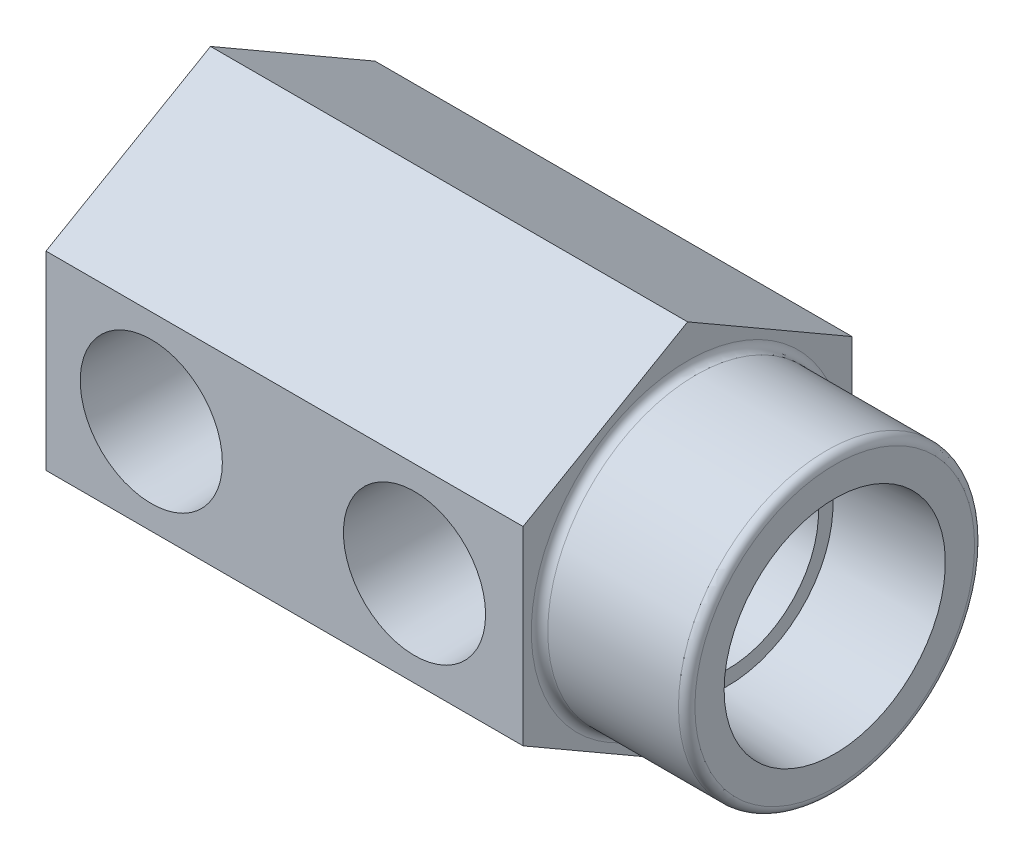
ISO-10303-21;
HEADER;
FILE_DESCRIPTION(('STEP AP214'),'2;1');
FILE_NAME('part.step','',(''),(''),'','','');
FILE_SCHEMA(('AUTOMOTIVE_DESIGN { 1 0 10303 214 1 1 1 1 }'));
ENDSEC;
DATA;
#1=APPLICATION_CONTEXT('core data for automotive mechanical design processes');
#2=APPLICATION_PROTOCOL_DEFINITION('international standard','automotive_design',2000,#1);
#3=PRODUCT_CONTEXT('',#1,'mechanical');
#4=PRODUCT('Part','Part','',(#3));
#5=PRODUCT_RELATED_PRODUCT_CATEGORY('part','',(#4));
#6=PRODUCT_DEFINITION_FORMATION('','',#4);
#7=PRODUCT_DEFINITION_CONTEXT('part definition',#1,'design');
#8=PRODUCT_DEFINITION('design','',#6,#7);
#9=PRODUCT_DEFINITION_SHAPE('','',#8);
#10=(LENGTH_UNIT() NAMED_UNIT(*) SI_UNIT(.MILLI.,.METRE.));
#11=(NAMED_UNIT(*) PLANE_ANGLE_UNIT() SI_UNIT($,.RADIAN.));
#12=(NAMED_UNIT(*) SI_UNIT($,.STERADIAN.) SOLID_ANGLE_UNIT());
#13=UNCERTAINTY_MEASURE_WITH_UNIT(LENGTH_MEASURE(1.E-05),#10,'distance_accuracy_value','');
#14=(GEOMETRIC_REPRESENTATION_CONTEXT(3) GLOBAL_UNCERTAINTY_ASSIGNED_CONTEXT((#13)) GLOBAL_UNIT_ASSIGNED_CONTEXT((#10,
#11,#12)) REPRESENTATION_CONTEXT('',''));
#15=CARTESIAN_POINT('',(0.,0.,0.));
#16=DIRECTION('',(0.,0.,1.));
#17=DIRECTION('',(1.,0.,0.));
#18=AXIS2_PLACEMENT_3D('',#15,#16,#17);
#19=CARTESIAN_POINT('',(35.56,0.,15.875));
#20=DIRECTION('',(0.,0.,1.));
#21=DIRECTION('',(1.,0.,0.));
#22=AXIS2_PLACEMENT_3D('',#19,#20,#21);
#23=CYLINDRICAL_SURFACE('',#22,5.5626);
#24=CARTESIAN_POINT('',(35.56,0.,3.175));
#25=DIRECTION('',(0.,0.,1.));
#26=DIRECTION('',(1.,0.,0.));
#27=AXIS2_PLACEMENT_3D('',#24,#25,#26);
#28=CIRCLE('',#27,5.5626);
#29=CARTESIAN_POINT('',(34.7229553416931,-5.49926131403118,3.175));
#30=VERTEX_POINT('',#29);
#31=CARTESIAN_POINT('',(36.1061,-5.53572881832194,3.175));
#32=VERTEX_POINT('',#31);
#33=EDGE_CURVE('E338',#30,#32,#28,.T.);
#34=ORIENTED_EDGE('',*,*,#33,.F.);
#35=CARTESIAN_POINT('',(34.7229553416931,-5.49926131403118,3.175));
#36=CARTESIAN_POINT('',(34.5703558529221,-5.47599499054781,3.21535633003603));
#37=CARTESIAN_POINT('',(34.4215971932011,-5.446894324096,3.26470494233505));
#38=CARTESIAN_POINT('',(34.1322869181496,-5.37831347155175,3.37644537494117));
#39=CARTESIAN_POINT('',(33.991701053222,-5.33888109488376,3.43877685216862));
#40=CARTESIAN_POINT('',(33.71815879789,-5.25078458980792,3.57185653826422));
#41=CARTESIAN_POINT('',(33.5851872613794,-5.20213968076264,3.642587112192));
#42=CARTESIAN_POINT('',(33.3257025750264,-5.09608670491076,3.78954133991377));
#43=CARTESIAN_POINT('',(33.1991990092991,-5.03866610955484,3.86577276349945));
#44=CARTESIAN_POINT('',(32.9139713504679,-4.89630133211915,4.04544483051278));
#45=CARTESIAN_POINT('',(32.7574407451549,-4.80834731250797,4.14998369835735));
#46=CARTESIAN_POINT('',(32.4542799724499,-4.6183334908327,4.36046217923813));
#47=CARTESIAN_POINT('',(32.3076484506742,-4.5162756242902,4.46640159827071));
#48=CARTESIAN_POINT('',(32.0241412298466,-4.29793311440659,4.67688688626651));
#49=CARTESIAN_POINT('',(31.8872695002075,-4.18164273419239,4.78143217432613));
#50=CARTESIAN_POINT('',(31.6239432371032,-3.93478698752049,4.9865547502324));
#51=CARTESIAN_POINT('',(31.4974853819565,-3.80422620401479,5.08713329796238));
#52=CARTESIAN_POINT('',(31.221113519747,-3.48887248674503,5.31012773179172));
#53=CARTESIAN_POINT('',(31.0749107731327,-3.29928047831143,5.43050667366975));
#54=CARTESIAN_POINT('',(30.8723855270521,-2.99724713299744,5.59931597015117));
#55=CARTESIAN_POINT('',(30.8076659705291,-2.89361324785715,5.65363243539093));
#56=CARTESIAN_POINT('',(30.6842756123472,-2.68048454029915,5.75774056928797));
#57=CARTESIAN_POINT('',(30.6256105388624,-2.57098431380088,5.80752794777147));
#58=CARTESIAN_POINT('',(30.5702574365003,-2.45865571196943,5.8547));
#59=B_SPLINE_CURVE_WITH_KNOTS('',3,(#35,#36,#37,#38,#39,#40,#41,#42,#43,#44,#45,#46,#47,#48,#49,
#50,#51,#52,#53,#54,#55,#56,#57,#58),.UNSPECIFIED.,.F.,.F.,(4,2,2,2,2,2,2,2,2,2,2,4),(0.,
0.477466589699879,0.952761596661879,1.42707574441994,1.90207348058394,2.52457565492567,
3.14699248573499,3.76966103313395,4.39213019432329,5.19358921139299,5.59442719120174,
5.99564099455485),.UNSPECIFIED.);
#60=CARTESIAN_POINT('',(30.5702574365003,-2.45865571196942,5.8547));
#61=VERTEX_POINT('',#60);
#62=EDGE_CURVE('E250',#30,#61,#59,.T.);
#63=ORIENTED_EDGE('',*,*,#62,.T.);
#64=CARTESIAN_POINT('',(35.56,0.,5.8547));
#65=DIRECTION('',(0.,0.,1.));
#66=DIRECTION('',(1.,0.,0.));
#67=AXIS2_PLACEMENT_3D('',#64,#65,#66);
#68=CIRCLE('',#67,5.56260000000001);
#69=CARTESIAN_POINT('',(36.1061,-5.53572881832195,5.8547));
#70=VERTEX_POINT('',#69);
#71=EDGE_CURVE('E347',#61,#70,#68,.T.);
#72=ORIENTED_EDGE('',*,*,#71,.T.);
#73=DIRECTION('',(0.,0.,1.));
#74=VECTOR('',#73,1.);
#75=CARTESIAN_POINT('',(36.1061,-5.53572881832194,15.875));
#76=LINE('',#75,#74);
#77=EDGE_CURVE('E286',#70,#32,#76,.F.);
#78=ORIENTED_EDGE('',*,*,#77,.T.);
#79=EDGE_LOOP('',(#34,#63,#72,#78));
#80=FACE_BOUND('',#79,.T.);
#81=ADVANCED_FACE('F35',(#80),#23,.F.);
#82=CARTESIAN_POINT('',(41.1226,0.,5.85470000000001));
#83=DIRECTION('',(0.,0.,-1.));
#84=DIRECTION('',(-1.,0.,0.));
#85=AXIS2_PLACEMENT_3D('',#82,#83,#84);
#86=PLANE('',#85);
#87=CARTESIAN_POINT('',(35.56,0.,5.85470000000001));
#88=DIRECTION('',(0.,0.,1.));
#89=DIRECTION('',(1.,0.,0.));
#90=AXIS2_PLACEMENT_3D('',#87,#88,#89);
#91=CIRCLE('',#90,6.55797879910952);
#92=CARTESIAN_POINT('',(36.5846323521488,6.47743888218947,5.85470000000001));
#93=VERTEX_POINT('',#92);
#94=CARTESIAN_POINT('',(29.4803537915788,2.45865571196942,5.85470000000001));
#95=VERTEX_POINT('',#94);
#96=EDGE_CURVE('E444',#93,#95,#91,.T.);
#97=ORIENTED_EDGE('',*,*,#96,.T.);
#98=DIRECTION('',(1.,0.,0.));
#99=VECTOR('',#98,1.);
#100=CARTESIAN_POINT('',(60.2361,2.45865571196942,5.85470000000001));
#101=LINE('',#100,#99);
#102=CARTESIAN_POINT('',(30.5702574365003,2.45865571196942,5.8547));
#103=VERTEX_POINT('',#102);
#104=EDGE_CURVE('E435',#95,#103,#101,.T.);
#105=ORIENTED_EDGE('',*,*,#104,.T.);
#106=CARTESIAN_POINT('',(36.1061,5.53572881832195,5.8547));
#107=VERTEX_POINT('',#106);
#108=EDGE_CURVE('E342',#107,#103,#68,.T.);
#109=ORIENTED_EDGE('',*,*,#108,.F.);
#110=DIRECTION('',(0.,1.,0.));
#111=VECTOR('',#110,1.);
#112=CARTESIAN_POINT('',(36.1061,0.,5.85470000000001));
#113=LINE('',#112,#111);
#114=CARTESIAN_POINT('',(36.1061,6.47743888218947,5.85470000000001));
#115=VERTEX_POINT('',#114);
#116=EDGE_CURVE('E313',#107,#115,#113,.T.);
#117=ORIENTED_EDGE('',*,*,#116,.T.);
#118=DIRECTION('',(-1.,0.,0.));
#119=VECTOR('',#118,1.);
#120=CARTESIAN_POINT('',(-14.0019251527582,6.47743888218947,5.85470000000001));
#121=LINE('',#120,#119);
#122=EDGE_CURVE('E345',#115,#93,#121,.F.);
#123=ORIENTED_EDGE('',*,*,#122,.T.);
#124=EDGE_LOOP('',(#97,#105,#109,#117,#123));
#125=FACE_BOUND('',#124,.T.);
#126=ADVANCED_FACE('F323',(#125),#86,.F.);
#127=CARTESIAN_POINT('',(35.56,0.,3.175));
#128=DIRECTION('',(0.,0.,1.));
#129=DIRECTION('',(1.,0.,0.));
#130=AXIS2_PLACEMENT_3D('',#127,#128,#129);
#131=CONICAL_SURFACE('',#130,5.5626,1.02974425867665);
#132=CARTESIAN_POINT('',(36.1061,5.53572881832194,3.175));
#133=VERTEX_POINT('',#132);
#134=CARTESIAN_POINT('',(34.7229553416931,5.49926131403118,3.175));
#135=VERTEX_POINT('',#134);
#136=EDGE_CURVE('E341',#133,#135,#28,.T.);
#137=ORIENTED_EDGE('',*,*,#136,.T.);
#138=CARTESIAN_POINT('',(31.8413553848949,5.18463122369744,3.66634682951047));
#139=CARTESIAN_POINT('',(32.1192691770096,5.23576548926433,3.59399699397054));
#140=CARTESIAN_POINT('',(32.3998284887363,5.28089614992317,3.52699465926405));
#141=CARTESIAN_POINT('',(32.9659526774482,5.35934788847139,3.40663405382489));
#142=CARTESIAN_POINT('',(33.2515249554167,5.39264963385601,3.35329815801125));
#143=CARTESIAN_POINT('',(33.8219023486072,5.44703907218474,3.26419001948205));
#144=CARTESIAN_POINT('',(34.1066472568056,5.46831283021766,3.2281515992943));
#145=CARTESIAN_POINT('',(34.6783385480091,5.49940001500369,3.17491601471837));
#146=CARTESIAN_POINT('',(34.9652827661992,5.50922353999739,3.15770224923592));
#147=CARTESIAN_POINT('',(35.3617063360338,5.51486937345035,3.14780924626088));
#148=CARTESIAN_POINT('',(35.4709639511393,5.51559574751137,3.14653649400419));
#149=CARTESIAN_POINT('',(35.6894723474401,5.51539103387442,3.14689902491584));
#150=CARTESIAN_POINT('',(35.7987231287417,5.5144600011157,3.14853421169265));
#151=CARTESIAN_POINT('',(36.1276236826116,5.50916085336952,3.15779174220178));
#152=CARTESIAN_POINT('',(36.3471211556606,5.50226809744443,3.16979812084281));
#153=CARTESIAN_POINT('',(36.566022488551,5.4920247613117,3.18750121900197));
#154=B_SPLINE_CURVE_WITH_KNOTS('',3,(#138,#139,#140,#141,#142,#143,#144,#145,#146,#147,#148,
#149,#150,#151,#152,#153),.UNSPECIFIED.,.F.,.F.,(4,2,2,2,2,2,2,4),(0.,0.875178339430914,
1.75178050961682,2.61442264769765,3.47630342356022,3.80406664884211,4.13181900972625,
4.79121989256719),.UNSPECIFIED.);
#155=CARTESIAN_POINT('',(36.1061,5.50859624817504,3.15877624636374));
#156=VERTEX_POINT('',#155);
#157=EDGE_CURVE('E256',#135,#156,#154,.T.);
#158=ORIENTED_EDGE('',*,*,#157,.T.);
#159=CARTESIAN_POINT('',(36.1061,-28.2240395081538,16.7945407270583));
#160=CARTESIAN_POINT('',(36.1061,-27.2410442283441,16.204009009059));
#161=CARTESIAN_POINT('',(36.1061,-26.2580446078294,15.6134845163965));
#162=CARTESIAN_POINT('',(36.1061,-24.2920308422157,14.4324593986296));
#163=CARTESIAN_POINT('',(36.1061,-23.3090166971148,13.8419587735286));
#164=CARTESIAN_POINT('',(36.1061,-21.3429632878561,12.66098795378));
#165=CARTESIAN_POINT('',(36.1061,-20.3599240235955,12.0705177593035));
#166=CARTESIAN_POINT('',(36.1061,-18.3938146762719,10.8896289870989));
#167=CARTESIAN_POINT('',(36.1061,-17.410744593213,10.2992104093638));
#168=CARTESIAN_POINT('',(36.1061,-15.4486424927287,9.12091026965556));
#169=CARTESIAN_POINT('',(36.1061,-14.4696106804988,8.53302836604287));
#170=CARTESIAN_POINT('',(36.1061,-12.5114562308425,7.35741498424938));
#171=CARTESIAN_POINT('',(36.1061,-11.5323335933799,6.76968350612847));
#172=CARTESIAN_POINT('',(36.1061,-9.57392101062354,5.59450775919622));
#173=CARTESIAN_POINT('',(36.1061,-8.59463106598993,5.00706348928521));
#174=CARTESIAN_POINT('',(36.1061,-7.12533786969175,4.1264956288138));
#175=CARTESIAN_POINT('',(36.1061,-6.63551391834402,3.83307286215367));
#176=CARTESIAN_POINT('',(36.1061,-5.65564068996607,3.24660385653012));
#177=CARTESIAN_POINT('',(36.1061,-5.16559141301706,2.95355761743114));
#178=CARTESIAN_POINT('',(36.1061,-4.48553738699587,2.54770611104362));
#179=CARTESIAN_POINT('',(36.1061,-4.29575276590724,2.43453206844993));
#180=CARTESIAN_POINT('',(36.1061,-3.91606443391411,2.2083820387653));
#181=CARTESIAN_POINT('',(36.1061,-3.72616072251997,2.09540605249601));
#182=CARTESIAN_POINT('',(36.1061,-3.34603165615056,1.86967770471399));
#183=CARTESIAN_POINT('',(36.1061,-3.15580616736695,1.75692556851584));
#184=CARTESIAN_POINT('',(36.1061,-2.77505897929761,1.53192622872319));
#185=CARTESIAN_POINT('',(36.1061,-2.58453728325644,1.41967901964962));
#186=CARTESIAN_POINT('',(36.1061,-2.29425738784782,1.24963512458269));
#187=CARTESIAN_POINT('',(36.1061,-2.1947028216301,1.19149099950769));
#188=CARTESIAN_POINT('',(36.1061,-1.99536574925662,1.07558778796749));
#189=CARTESIAN_POINT('',(36.1061,-1.89558323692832,1.01782871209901));
#190=CARTESIAN_POINT('',(36.1061,-1.69580348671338,0.902982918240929));
#191=CARTESIAN_POINT('',(36.1061,-1.59580669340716,0.845895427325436));
#192=CARTESIAN_POINT('',(36.1061,-1.39526666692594,0.732697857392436));
#193=CARTESIAN_POINT('',(36.1061,-1.29472347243,0.676587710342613));
#194=CARTESIAN_POINT('',(36.1061,-1.13983986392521,0.591967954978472));
#195=CARTESIAN_POINT('',(36.1061,-1.08585527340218,0.562808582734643));
#196=CARTESIAN_POINT('',(36.1061,-0.977481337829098,0.505253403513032));
#197=CARTESIAN_POINT('',(36.1061,-0.923092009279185,0.476857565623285));
#198=CARTESIAN_POINT('',(36.1061,-0.813475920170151,0.421101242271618));
#199=CARTESIAN_POINT('',(36.1061,-0.758246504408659,0.393745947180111));
#200=CARTESIAN_POINT('',(36.1061,-0.646900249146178,0.340912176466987));
#201=CARTESIAN_POINT('',(36.1061,-0.590783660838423,0.31543318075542));
#202=CARTESIAN_POINT('',(36.1061,-0.501289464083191,0.277849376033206));
#203=CARTESIAN_POINT('',(36.1061,-0.468376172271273,0.264660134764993));
#204=CARTESIAN_POINT('',(36.1061,-0.401987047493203,0.239794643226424));
#205=CARTESIAN_POINT('',(36.1061,-0.36851103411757,0.228118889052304));
#206=CARTESIAN_POINT('',(36.1061,-0.267610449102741,0.196453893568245));
#207=CARTESIAN_POINT('',(36.1061,-0.199064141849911,0.179529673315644));
#208=CARTESIAN_POINT('',(36.1061,-0.100718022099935,0.165890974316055));
#209=CARTESIAN_POINT('',(36.1061,-0.0717594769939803,0.163145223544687));
#210=CARTESIAN_POINT('',(36.1061,-0.0137135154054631,0.160426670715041));
#211=CARTESIAN_POINT('',(36.1061,0.0153738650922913,0.160453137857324));
#212=CARTESIAN_POINT('',(36.1061,0.0735339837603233,0.163282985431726));
#213=CARTESIAN_POINT('',(36.1061,0.102606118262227,0.166098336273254));
#214=CARTESIAN_POINT('',(36.1061,0.160391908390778,0.174224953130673));
#215=CARTESIAN_POINT('',(36.1061,0.189105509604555,0.179536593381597));
#216=CARTESIAN_POINT('',(36.1061,0.261758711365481,0.195691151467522));
#217=CARTESIAN_POINT('',(36.1061,0.305373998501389,0.207969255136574));
#218=CARTESIAN_POINT('',(36.1061,0.391557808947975,0.235819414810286));
#219=CARTESIAN_POINT('',(36.1061,0.434124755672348,0.251396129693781));
#220=CARTESIAN_POINT('',(36.1061,0.518590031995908,0.28475646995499));
#221=CARTESIAN_POINT('',(36.1061,0.560484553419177,0.302549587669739));
#222=CARTESIAN_POINT('',(36.1061,0.643609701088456,0.339546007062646));
#223=CARTESIAN_POINT('',(36.1061,0.684840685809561,0.358748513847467));
#224=CARTESIAN_POINT('',(36.1061,0.767542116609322,0.398457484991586));
#225=CARTESIAN_POINT('',(36.1061,0.809004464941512,0.418980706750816));
#226=CARTESIAN_POINT('',(36.1061,0.891575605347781,0.460728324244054));
#227=CARTESIAN_POINT('',(36.1061,0.932684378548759,0.481952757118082));
#228=CARTESIAN_POINT('',(36.1061,1.0553809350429,0.546245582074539));
#229=CARTESIAN_POINT('',(36.1061,1.13658057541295,0.590052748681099));
#230=CARTESIAN_POINT('',(36.1061,1.29650766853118,0.677739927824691));
#231=CARTESIAN_POINT('',(36.1061,1.37524894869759,0.721594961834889));
#232=CARTESIAN_POINT('',(36.1061,1.53235983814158,0.809969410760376));
#233=CARTESIAN_POINT('',(36.1061,1.61072943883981,0.85448884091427));
#234=CARTESIAN_POINT('',(36.1061,1.8454819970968,0.988692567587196));
#235=CARTESIAN_POINT('',(36.1061,2.0014984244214,1.07901656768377));
#236=CARTESIAN_POINT('',(36.1061,2.31322637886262,1.26060812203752));
#237=CARTESIAN_POINT('',(36.1061,2.46893732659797,1.35187666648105));
#238=CARTESIAN_POINT('',(36.1061,2.78006502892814,1.53490063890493));
#239=CARTESIAN_POINT('',(36.1061,2.93548179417,1.62665604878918));
#240=CARTESIAN_POINT('',(36.1061,3.24368338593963,1.80901902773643));
#241=CARTESIAN_POINT('',(36.1061,3.39647102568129,1.89962184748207));
#242=CARTESIAN_POINT('',(36.1061,3.70193039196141,2.08102605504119));
#243=CARTESIAN_POINT('',(36.1061,3.85460211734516,2.17182744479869));
#244=CARTESIAN_POINT('',(36.1061,4.3123683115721,2.44436054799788));
#245=CARTESIAN_POINT('',(36.1061,4.61734105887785,2.62629665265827));
#246=CARTESIAN_POINT('',(36.1061,5.5238618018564,3.16766246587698));
#247=CARTESIAN_POINT('',(36.1061,6.12516662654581,3.52749910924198));
#248=CARTESIAN_POINT('',(36.1061,7.32752421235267,4.24759500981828));
#249=CARTESIAN_POINT('',(36.1061,7.92857697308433,4.6078542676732));
#250=CARTESIAN_POINT('',(36.1061,9.13066140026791,5.32866239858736));
#251=CARTESIAN_POINT('',(36.1061,9.73169304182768,5.68921131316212));
#252=CARTESIAN_POINT('',(36.1061,10.933681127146,6.41043377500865));
#253=CARTESIAN_POINT('',(36.1061,11.5346375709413,6.77110732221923));
#254=CARTESIAN_POINT('',(36.1061,13.3881993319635,7.88371083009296));
#255=CARTESIAN_POINT('',(36.1061,14.6407285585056,8.63576755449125));
#256=CARTESIAN_POINT('',(36.1061,16.5193369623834,9.76388654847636));
#257=CARTESIAN_POINT('',(36.1061,17.1454482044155,10.1398954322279));
#258=CARTESIAN_POINT('',(36.1061,18.3976538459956,10.8919409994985));
#259=CARTESIAN_POINT('',(36.1061,19.0237482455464,11.2679776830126));
#260=CARTESIAN_POINT('',(36.1061,19.6498365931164,11.6440244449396));
#261=B_SPLINE_CURVE_WITH_KNOTS('',3,(#159,#160,#161,#162,#163,#164,#165,#166,#167,#168,#169,
#170,#171,#172,#173,#174,#175,#176,#177,#178,#179,#180,#181,#182,#183,#184,#185,#186,#187,#188,
#189,#190,#191,#192,#193,#194,#195,#196,#197,#198,#199,#200,#201,#202,#203,#204,#205,#206,#207,
#208,#209,#210,#211,#212,#213,#214,#215,#216,#217,#218,#219,#220,#221,#222,#223,#224,#225,#226,
#227,#228,#229,#230,#231,#232,#233,#234,#235,#236,#237,#238,#239,#240,#241,#242,#243,#244,#245,
#246,#247,#248,#249,#250,#251,#252,#253,#254,#255,#256,#257,#258,#259,#260),.UNSPECIFIED.,.F.,
.F.,(4,2,2,2,2,2,2,2,2,2,2,2,2,2,2,2,2,2,2,2,2,2,2,2,2,2,2,2,2,2,2,2,2,2,2,2,2,2,2,2,2,2,2,2,2,
2,2,2,2,2,4),(0.,3.44021320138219,6.88042688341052,10.3206581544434,13.7608889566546,
17.1868159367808,20.6127442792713,24.038659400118,25.7516158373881,27.4645716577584,
28.1274736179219,28.7903783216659,29.4537701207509,30.1171547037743,30.463025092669,
30.8089049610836,31.1543375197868,31.4997459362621,31.6838112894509,31.8678691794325,
32.0527490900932,32.2375775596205,32.3439108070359,32.4502788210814,32.6608790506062,
32.7480261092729,32.8351501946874,32.9226498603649,33.0101626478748,33.1458755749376,
33.2817814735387,33.4182908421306,33.5547238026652,33.6935055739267,33.83229470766,
34.1090649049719,34.3794522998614,34.6498459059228,35.1906684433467,35.7321310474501,
36.273573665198,36.8064678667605,37.3393673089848,38.4047223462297,40.5069703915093,
42.6092216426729,44.7118654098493,46.8145081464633,51.1974031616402,53.3884261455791,
55.5794487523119),.UNSPECIFIED.);
#262=EDGE_CURVE('E287',#156,#133,#261,.T.);
#263=ORIENTED_EDGE('',*,*,#262,.T.);
#264=EDGE_LOOP('',(#137,#158,#263));
#265=FACE_BOUND('',#264,.T.);
#266=ADVANCED_FACE('F272',(#265),#131,.F.);
#267=CARTESIAN_POINT('',(60.2361,0.,0.));
#268=DIRECTION('',(1.,0.,0.));
#269=DIRECTION('',(0.,0.,-1.));
#270=AXIS2_PLACEMENT_3D('',#267,#268,#269);
#271=PLANE('',#270);
#272=CARTESIAN_POINT('',(60.2361,0.,0.));
#273=DIRECTION('',(1.,0.,0.));
#274=DIRECTION('',(0.,0.,-1.));
#275=AXIS2_PLACEMENT_3D('',#272,#273,#274);
#276=CIRCLE('',#275,13.49375);
#277=CARTESIAN_POINT('',(60.2361,0.,-13.49375));
#278=VERTEX_POINT('',#277);
#279=EDGE_CURVE('E311',#278,#278,#276,.T.);
#280=ORIENTED_EDGE('',*,*,#279,.T.);
#281=EDGE_LOOP('',(#280));
#282=FACE_BOUND('',#281,.T.);
#283=CARTESIAN_POINT('',(60.2361,0.,0.));
#284=DIRECTION('',(-1.,0.,0.));
#285=DIRECTION('',(0.,0.,1.));
#286=AXIS2_PLACEMENT_3D('',#283,#284,#285);
#287=CIRCLE('',#286,10.6743844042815);
#288=CARTESIAN_POINT('',(60.2361,0.,10.6743844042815));
#289=VERTEX_POINT('',#288);
#290=EDGE_CURVE('E370',#289,#289,#287,.T.);
#291=ORIENTED_EDGE('',*,*,#290,.T.);
#292=EDGE_LOOP('',(#291));
#293=FACE_BOUND('',#292,.T.);
#294=ADVANCED_FACE('F523',(#282,#293),#271,.T.);
#295=CARTESIAN_POINT('',(46.0375,-9.16543552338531,-15.875));
#296=DIRECTION('',(1.,0.,0.));
#297=DIRECTION('',(0.,0.,-1.));
#298=AXIS2_PLACEMENT_3D('',#295,#296,#297);
#299=PLANE('',#298);
#300=CARTESIAN_POINT('',(46.0375,0.,0.));
#301=DIRECTION('',(1.,0.,0.));
#302=DIRECTION('',(0.,0.,-1.));
#303=AXIS2_PLACEMENT_3D('',#300,#301,#302);
#304=CIRCLE('',#303,15.08125);
#305=CARTESIAN_POINT('',(46.0375,0.,-15.08125));
#306=VERTEX_POINT('',#305);
#307=EDGE_CURVE('E44',#306,#306,#304,.F.);
#308=ORIENTED_EDGE('',*,*,#307,.T.);
#309=EDGE_LOOP('',(#308));
#310=FACE_BOUND('',#309,.T.);
#311=DIRECTION('',(0.,0.5,-0.866025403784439));
#312=VECTOR('',#311,1.);
#313=CARTESIAN_POINT('',(46.0375,-18.3308710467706,0.));
#314=LINE('',#313,#312);
#315=CARTESIAN_POINT('',(46.0375,-18.3308710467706,0.));
#316=VERTEX_POINT('',#315);
#317=CARTESIAN_POINT('',(46.0375,-9.16543552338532,-15.875));
#318=VERTEX_POINT('',#317);
#319=EDGE_CURVE('E374',#316,#318,#314,.T.);
#320=ORIENTED_EDGE('',*,*,#319,.T.);
#321=DIRECTION('',(0.,1.,0.));
#322=VECTOR('',#321,1.);
#323=CARTESIAN_POINT('',(46.0375,-9.16543552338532,-15.875));
#324=LINE('',#323,#322);
#325=CARTESIAN_POINT('',(46.0375,9.16543552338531,-15.875));
#326=VERTEX_POINT('',#325);
#327=EDGE_CURVE('E377',#318,#326,#324,.T.);
#328=ORIENTED_EDGE('',*,*,#327,.T.);
#329=DIRECTION('',(0.,0.5,0.866025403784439));
#330=VECTOR('',#329,1.);
#331=CARTESIAN_POINT('',(46.0375,9.16543552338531,-15.875));
#332=LINE('',#331,#330);
#333=CARTESIAN_POINT('',(46.0375,18.3308710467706,0.));
#334=VERTEX_POINT('',#333);
#335=EDGE_CURVE('E380',#326,#334,#332,.T.);
#336=ORIENTED_EDGE('',*,*,#335,.T.);
#337=DIRECTION('',(0.,-0.5,0.866025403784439));
#338=VECTOR('',#337,1.);
#339=CARTESIAN_POINT('',(46.0375,18.3308710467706,0.));
#340=LINE('',#339,#338);
#341=CARTESIAN_POINT('',(46.0375,9.16543552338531,15.875));
#342=VERTEX_POINT('',#341);
#343=EDGE_CURVE('E382',#334,#342,#340,.T.);
#344=ORIENTED_EDGE('',*,*,#343,.T.);
#345=DIRECTION('',(0.,-1.,0.));
#346=VECTOR('',#345,1.);
#347=CARTESIAN_POINT('',(46.0375,9.16543552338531,15.875));
#348=LINE('',#347,#346);
#349=CARTESIAN_POINT('',(46.0375,-9.16543552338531,15.875));
#350=VERTEX_POINT('',#349);
#351=EDGE_CURVE('E384',#342,#350,#348,.T.);
#352=ORIENTED_EDGE('',*,*,#351,.T.);
#353=DIRECTION('',(0.,-0.5,-0.866025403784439));
#354=VECTOR('',#353,1.);
#355=CARTESIAN_POINT('',(46.0375,-9.16543552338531,15.875));
#356=LINE('',#355,#354);
#357=EDGE_CURVE('E386',#350,#316,#356,.T.);
#358=ORIENTED_EDGE('',*,*,#357,.T.);
#359=EDGE_LOOP('',(#320,#328,#336,#344,#352,#358));
#360=FACE_BOUND('',#359,.T.);
#361=ADVANCED_FACE('F483',(#310,#360),#299,.T.);
#362=CARTESIAN_POINT('',(46.0375,-18.3308710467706,0.));
#363=DIRECTION('',(0.,0.866025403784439,0.5));
#364=DIRECTION('',(0.,-0.5,0.866025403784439));
#365=AXIS2_PLACEMENT_3D('',#362,#363,#364);
#366=PLANE('',#365);
#367=DIRECTION('',(0.,0.5,-0.866025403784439));
#368=VECTOR('',#367,1.);
#369=CARTESIAN_POINT('',(0.,-18.3308710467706,0.));
#370=LINE('',#369,#368);
#371=CARTESIAN_POINT('',(0.,-18.3308710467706,0.));
#372=VERTEX_POINT('',#371);
#373=CARTESIAN_POINT('',(0.,-9.16543552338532,-15.875));
#374=VERTEX_POINT('',#373);
#375=EDGE_CURVE('E373',#372,#374,#370,.T.);
#376=ORIENTED_EDGE('',*,*,#375,.T.);
#377=DIRECTION('',(-1.,0.,0.));
#378=VECTOR('',#377,1.);
#379=CARTESIAN_POINT('',(46.0375,-9.16543552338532,-15.875));
#380=LINE('',#379,#378);
#381=EDGE_CURVE('E288',#318,#374,#380,.T.);
#382=ORIENTED_EDGE('',*,*,#381,.F.);
#383=ORIENTED_EDGE('',*,*,#319,.F.);
#384=DIRECTION('',(-1.,0.,0.));
#385=VECTOR('',#384,1.);
#386=CARTESIAN_POINT('',(46.0375,-18.3308710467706,0.));
#387=LINE('',#386,#385);
#388=EDGE_CURVE('E388',#316,#372,#387,.T.);
#389=ORIENTED_EDGE('',*,*,#388,.T.);
#390=EDGE_LOOP('',(#376,#382,#383,#389));
#391=FACE_BOUND('',#390,.T.);
#392=ADVANCED_FACE('F480',(#391),#366,.F.);
#393=CARTESIAN_POINT('',(46.0375,-9.16543552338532,-15.875));
#394=DIRECTION('',(0.,0.,1.));
#395=DIRECTION('',(1.,0.,0.));
#396=AXIS2_PLACEMENT_3D('',#393,#394,#395);
#397=PLANE('',#396);
#398=CARTESIAN_POINT('',(10.16,0.,-15.875));
#399=DIRECTION('',(0.,0.,-1.));
#400=DIRECTION('',(-1.,0.,0.));
#401=AXIS2_PLACEMENT_3D('',#398,#399,#400);
#402=CIRCLE('',#401,6.858);
#403=CARTESIAN_POINT('',(3.302,0.,-15.875));
#404=VERTEX_POINT('',#403);
#405=EDGE_CURVE('E354',#404,#404,#402,.T.);
#406=ORIENTED_EDGE('',*,*,#405,.F.);
#407=EDGE_LOOP('',(#406));
#408=FACE_BOUND('',#407,.T.);
#409=DIRECTION('',(0.,1.,0.));
#410=VECTOR('',#409,1.);
#411=CARTESIAN_POINT('',(0.,-9.16543552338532,-15.875));
#412=LINE('',#411,#410);
#413=CARTESIAN_POINT('',(0.,9.16543552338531,-15.875));
#414=VERTEX_POINT('',#413);
#415=EDGE_CURVE('E391',#374,#414,#412,.T.);
#416=ORIENTED_EDGE('',*,*,#415,.T.);
#417=DIRECTION('',(-1.,0.,0.));
#418=VECTOR('',#417,1.);
#419=CARTESIAN_POINT('',(46.0375,9.16543552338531,-15.875));
#420=LINE('',#419,#418);
#421=EDGE_CURVE('E410',#326,#414,#420,.T.);
#422=ORIENTED_EDGE('',*,*,#421,.F.);
#423=ORIENTED_EDGE('',*,*,#327,.F.);
#424=ORIENTED_EDGE('',*,*,#381,.T.);
#425=EDGE_LOOP('',(#416,#422,#423,#424));
#426=FACE_BOUND('',#425,.T.);
#427=ADVANCED_FACE('F489',(#408,#426),#397,.F.);
#428=CARTESIAN_POINT('',(46.0375,9.16543552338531,-15.875));
#429=DIRECTION('',(0.,-0.866025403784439,0.5));
#430=DIRECTION('',(0.,-0.5,-0.866025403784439));
#431=AXIS2_PLACEMENT_3D('',#428,#429,#430);
#432=PLANE('',#431);
#433=DIRECTION('',(0.,0.5,0.866025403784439));
#434=VECTOR('',#433,1.);
#435=CARTESIAN_POINT('',(0.,9.16543552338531,-15.875));
#436=LINE('',#435,#434);
#437=CARTESIAN_POINT('',(0.,18.3308710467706,0.));
#438=VERTEX_POINT('',#437);
#439=EDGE_CURVE('E393',#414,#438,#436,.T.);
#440=ORIENTED_EDGE('',*,*,#439,.T.);
#441=DIRECTION('',(-1.,0.,0.));
#442=VECTOR('',#441,1.);
#443=CARTESIAN_POINT('',(46.0375,18.3308710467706,0.));
#444=LINE('',#443,#442);
#445=EDGE_CURVE('E408',#334,#438,#444,.T.);
#446=ORIENTED_EDGE('',*,*,#445,.F.);
#447=ORIENTED_EDGE('',*,*,#335,.F.);
#448=ORIENTED_EDGE('',*,*,#421,.T.);
#449=EDGE_LOOP('',(#440,#446,#447,#448));
#450=FACE_BOUND('',#449,.T.);
#451=ADVANCED_FACE('F487',(#450),#432,.F.);
#452=CARTESIAN_POINT('',(46.0375,18.3308710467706,0.));
#453=DIRECTION('',(0.,-0.866025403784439,-0.5));
#454=DIRECTION('',(0.,0.5,-0.866025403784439));
#455=AXIS2_PLACEMENT_3D('',#452,#453,#454);
#456=PLANE('',#455);
#457=DIRECTION('',(0.,-0.5,0.866025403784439));
#458=VECTOR('',#457,1.);
#459=CARTESIAN_POINT('',(0.,18.3308710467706,0.));
#460=LINE('',#459,#458);
#461=CARTESIAN_POINT('',(0.,9.16543552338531,15.875));
#462=VERTEX_POINT('',#461);
#463=EDGE_CURVE('E395',#438,#462,#460,.T.);
#464=ORIENTED_EDGE('',*,*,#463,.T.);
#465=DIRECTION('',(-1.,0.,0.));
#466=VECTOR('',#465,1.);
#467=CARTESIAN_POINT('',(46.0375,9.16543552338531,15.875));
#468=LINE('',#467,#466);
#469=EDGE_CURVE('E405',#342,#462,#468,.T.);
#470=ORIENTED_EDGE('',*,*,#469,.F.);
#471=ORIENTED_EDGE('',*,*,#343,.F.);
#472=ORIENTED_EDGE('',*,*,#445,.T.);
#473=EDGE_LOOP('',(#464,#470,#471,#472));
#474=FACE_BOUND('',#473,.T.);
#475=ADVANCED_FACE('F463',(#474),#456,.F.);
#476=CARTESIAN_POINT('',(46.0375,9.16543552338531,15.875));
#477=DIRECTION('',(0.,0.,-1.));
#478=DIRECTION('',(-1.,0.,0.));
#479=AXIS2_PLACEMENT_3D('',#476,#477,#478);
#480=PLANE('',#479);
#481=CARTESIAN_POINT('',(10.16,0.,15.875));
#482=DIRECTION('',(0.,0.,1.));
#483=DIRECTION('',(1.,0.,0.));
#484=AXIS2_PLACEMENT_3D('',#481,#482,#483);
#485=CIRCLE('',#484,6.858);
#486=CARTESIAN_POINT('',(17.018,0.,15.875));
#487=VERTEX_POINT('',#486);
#488=EDGE_CURVE('E201',#487,#487,#485,.T.);
#489=ORIENTED_EDGE('',*,*,#488,.F.);
#490=EDGE_LOOP('',(#489));
#491=FACE_BOUND('',#490,.T.);
#492=CARTESIAN_POINT('',(35.56,0.,15.875));
#493=DIRECTION('',(0.,0.,1.));
#494=DIRECTION('',(1.,0.,0.));
#495=AXIS2_PLACEMENT_3D('',#492,#493,#494);
#496=CIRCLE('',#495,6.858);
#497=CARTESIAN_POINT('',(42.418,0.,15.875));
#498=VERTEX_POINT('',#497);
#499=EDGE_CURVE('E445',#498,#498,#496,.T.);
#500=ORIENTED_EDGE('',*,*,#499,.F.);
#501=EDGE_LOOP('',(#500));
#502=FACE_BOUND('',#501,.T.);
#503=DIRECTION('',(0.,-1.,0.));
#504=VECTOR('',#503,1.);
#505=CARTESIAN_POINT('',(0.,9.16543552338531,15.875));
#506=LINE('',#505,#504);
#507=CARTESIAN_POINT('',(0.,-9.16543552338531,15.875));
#508=VERTEX_POINT('',#507);
#509=EDGE_CURVE('E397',#462,#508,#506,.T.);
#510=ORIENTED_EDGE('',*,*,#509,.T.);
#511=DIRECTION('',(-1.,0.,0.));
#512=VECTOR('',#511,1.);
#513=CARTESIAN_POINT('',(46.0375,-9.16543552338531,15.875));
#514=LINE('',#513,#512);
#515=EDGE_CURVE('E402',#350,#508,#514,.T.);
#516=ORIENTED_EDGE('',*,*,#515,.F.);
#517=ORIENTED_EDGE('',*,*,#351,.F.);
#518=ORIENTED_EDGE('',*,*,#469,.T.);
#519=EDGE_LOOP('',(#510,#516,#517,#518));
#520=FACE_BOUND('',#519,.T.);
#521=ADVANCED_FACE('F459',(#491,#502,#520),#480,.F.);
#522=CARTESIAN_POINT('',(46.0375,-9.16543552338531,15.875));
#523=DIRECTION('',(0.,0.866025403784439,-0.5));
#524=DIRECTION('',(0.,0.5,0.866025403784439));
#525=AXIS2_PLACEMENT_3D('',#522,#523,#524);
#526=PLANE('',#525);
#527=DIRECTION('',(0.,-0.5,-0.866025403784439));
#528=VECTOR('',#527,1.);
#529=CARTESIAN_POINT('',(0.,-9.16543552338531,15.875));
#530=LINE('',#529,#528);
#531=EDGE_CURVE('E378',#508,#372,#530,.T.);
#532=ORIENTED_EDGE('',*,*,#531,.T.);
#533=ORIENTED_EDGE('',*,*,#388,.F.);
#534=ORIENTED_EDGE('',*,*,#357,.F.);
#535=ORIENTED_EDGE('',*,*,#515,.T.);
#536=EDGE_LOOP('',(#532,#533,#534,#535));
#537=FACE_BOUND('',#536,.T.);
#538=ADVANCED_FACE('F462',(#537),#526,.F.);
#539=CARTESIAN_POINT('',(0.,-9.16543552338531,-15.875));
#540=DIRECTION('',(1.,0.,0.));
#541=DIRECTION('',(0.,0.,-1.));
#542=AXIS2_PLACEMENT_3D('',#539,#540,#541);
#543=PLANE('',#542);
#544=ORIENTED_EDGE('',*,*,#375,.F.);
#545=ORIENTED_EDGE('',*,*,#531,.F.);
#546=ORIENTED_EDGE('',*,*,#509,.F.);
#547=ORIENTED_EDGE('',*,*,#463,.F.);
#548=ORIENTED_EDGE('',*,*,#439,.F.);
#549=ORIENTED_EDGE('',*,*,#415,.F.);
#550=EDGE_LOOP('',(#544,#545,#546,#547,#548,#549));
#551=FACE_BOUND('',#550,.T.);
#552=ADVANCED_FACE('F478',(#551),#543,.F.);
#553=CARTESIAN_POINT('',(60.2361,0.,0.));
#554=DIRECTION('',(-1.,0.,0.));
#555=DIRECTION('',(0.,0.,1.));
#556=AXIS2_PLACEMENT_3D('',#553,#554,#555);
#557=CYLINDRICAL_SURFACE('',#556,14.2875);
#558=CARTESIAN_POINT('',(59.44235,0.,0.));
#559=DIRECTION('',(1.,0.,0.));
#560=DIRECTION('',(0.,0.,-1.));
#561=AXIS2_PLACEMENT_3D('',#558,#559,#560);
#562=CIRCLE('',#561,14.2875);
#563=CARTESIAN_POINT('',(59.44235,0.,14.2875));
#564=VERTEX_POINT('',#563);
#565=EDGE_CURVE('E509',#564,#564,#562,.F.);
#566=CARTESIAN_POINT('',(46.83125,0.,0.));
#567=DIRECTION('',(1.,0.,0.));
#568=DIRECTION('',(0.,0.,-1.));
#569=AXIS2_PLACEMENT_3D('',#566,#567,#568);
#570=CIRCLE('',#569,14.2875);
#571=CARTESIAN_POINT('',(46.83125,0.,14.2875));
#572=VERTEX_POINT('',#571);
#573=EDGE_CURVE('E513',#572,#572,#570,.T.);
#574=CARTESIAN_POINT('',(59.44235,0.,14.2875));
#575=CARTESIAN_POINT('',(59.310984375,0.,14.2875));
#576=CARTESIAN_POINT('',(59.17961875,0.,14.2875));
#577=CARTESIAN_POINT('',(58.9168875,0.,14.2875));
#578=CARTESIAN_POINT('',(58.785521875,0.,14.2875));
#579=CARTESIAN_POINT('',(58.522790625,0.,14.2875));
#580=CARTESIAN_POINT('',(58.391425,0.,14.2875));
#581=CARTESIAN_POINT('',(58.12869375,0.,14.2875));
#582=CARTESIAN_POINT('',(57.997328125,0.,14.2875));
#583=CARTESIAN_POINT('',(57.734596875,0.,14.2875));
#584=CARTESIAN_POINT('',(57.60323125,0.,14.2875));
#585=CARTESIAN_POINT('',(57.3405,0.,14.2875));
#586=CARTESIAN_POINT('',(57.209134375,0.,14.2875));
#587=CARTESIAN_POINT('',(56.946403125,0.,14.2875));
#588=CARTESIAN_POINT('',(56.8150375,0.,14.2875));
#589=CARTESIAN_POINT('',(56.55230625,0.,14.2875));
#590=CARTESIAN_POINT('',(56.420940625,0.,14.2875));
#591=CARTESIAN_POINT('',(56.158209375,0.,14.2875));
#592=CARTESIAN_POINT('',(56.02684375,0.,14.2875));
#593=CARTESIAN_POINT('',(55.7641125,0.,14.2875));
#594=CARTESIAN_POINT('',(55.632746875,0.,14.2875));
#595=CARTESIAN_POINT('',(55.370015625,0.,14.2875));
#596=CARTESIAN_POINT('',(55.23865,0.,14.2875));
#597=CARTESIAN_POINT('',(54.97591875,0.,14.2875));
#598=CARTESIAN_POINT('',(54.844553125,0.,14.2875));
#599=CARTESIAN_POINT('',(54.581821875,0.,14.2875));
#600=CARTESIAN_POINT('',(54.45045625,0.,14.2875));
#601=CARTESIAN_POINT('',(54.187725,0.,14.2875));
#602=CARTESIAN_POINT('',(54.056359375,0.,14.2875));
#603=CARTESIAN_POINT('',(53.793628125,0.,14.2875));
#604=CARTESIAN_POINT('',(53.6622625,0.,14.2875));
#605=CARTESIAN_POINT('',(53.39953125,0.,14.2875));
#606=CARTESIAN_POINT('',(53.268165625,0.,14.2875));
#607=CARTESIAN_POINT('',(53.005434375,0.,14.2875));
#608=CARTESIAN_POINT('',(52.87406875,0.,14.2875));
#609=CARTESIAN_POINT('',(52.6113375,0.,14.2875));
#610=CARTESIAN_POINT('',(52.479971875,0.,14.2875));
#611=CARTESIAN_POINT('',(52.217240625,0.,14.2875));
#612=CARTESIAN_POINT('',(52.085875,0.,14.2875));
#613=CARTESIAN_POINT('',(51.82314375,0.,14.2875));
#614=CARTESIAN_POINT('',(51.691778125,0.,14.2875));
#615=CARTESIAN_POINT('',(51.429046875,0.,14.2875));
#616=CARTESIAN_POINT('',(51.29768125,0.,14.2875));
#617=CARTESIAN_POINT('',(51.03495,0.,14.2875));
#618=CARTESIAN_POINT('',(50.903584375,0.,14.2875));
#619=CARTESIAN_POINT('',(50.640853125,0.,14.2875));
#620=CARTESIAN_POINT('',(50.5094875,0.,14.2875));
#621=CARTESIAN_POINT('',(50.24675625,0.,14.2875));
#622=CARTESIAN_POINT('',(50.115390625,0.,14.2875));
#623=CARTESIAN_POINT('',(49.852659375,0.,14.2875));
#624=CARTESIAN_POINT('',(49.72129375,0.,14.2875));
#625=CARTESIAN_POINT('',(49.4585625,0.,14.2875));
#626=CARTESIAN_POINT('',(49.327196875,0.,14.2875));
#627=CARTESIAN_POINT('',(49.064465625,0.,14.2875));
#628=CARTESIAN_POINT('',(48.9331,0.,14.2875));
#629=CARTESIAN_POINT('',(48.67036875,0.,14.2875));
#630=CARTESIAN_POINT('',(48.539003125,0.,14.2875));
#631=CARTESIAN_POINT('',(48.276271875,0.,14.2875));
#632=CARTESIAN_POINT('',(48.14490625,0.,14.2875));
#633=CARTESIAN_POINT('',(47.882175,0.,14.2875));
#634=CARTESIAN_POINT('',(47.750809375,0.,14.2875));
#635=CARTESIAN_POINT('',(47.488078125,0.,14.2875));
#636=CARTESIAN_POINT('',(47.3567125,0.,14.2875));
#637=CARTESIAN_POINT('',(47.09398125,0.,14.2875));
#638=CARTESIAN_POINT('',(46.962615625,0.,14.2875));
#639=CARTESIAN_POINT('',(46.83125,0.,14.2875));
#640=B_SPLINE_CURVE_WITH_KNOTS('',3,(#574,#575,#576,#577,#578,#579,#580,#581,#582,#583,#584,
#585,#586,#587,#588,#589,#590,#591,#592,#593,#594,#595,#596,#597,#598,#599,#600,#601,#602,#603,
#604,#605,#606,#607,#608,#609,#610,#611,#612,#613,#614,#615,#616,#617,#618,#619,#620,#621,#622,
#623,#624,#625,#626,#627,#628,#629,#630,#631,#632,#633,#634,#635,#636,#637,#638,#639),
.UNSPECIFIED.,.F.,.F.,(4,2,2,2,2,2,2,2,2,2,2,2,2,2,2,2,2,2,2,2,2,2,2,2,2,2,2,2,2,2,2,2,4),(0.,
0.394096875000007,0.788193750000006,1.18229062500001,1.57638750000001,1.970484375,2.36458125,
2.758678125,3.152775,3.546871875,3.94096875,4.335065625,4.7291625,5.123259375,5.51735625,
5.911453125,6.30555,6.699646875,7.09374375,7.487840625,7.8819375,8.276034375,8.67013125,
9.064228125,9.458325,9.852421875,10.24651875,10.640615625,11.0347125,11.428809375,11.82290625,
12.217003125,12.6111),.UNSPECIFIED.);
#641=EDGE_CURVE('BSEAM531',#564,#572,#640,.T.);
#642=ORIENTED_EDGE('',*,*,#565,.T.);
#643=ORIENTED_EDGE('',*,*,#573,.T.);
#644=ORIENTED_EDGE('',*,*,#641,.T.);
#645=ORIENTED_EDGE('',*,*,#641,.F.);
#646=EDGE_LOOP('',(#642,#644,#643,#645));
#647=FACE_BOUND('',#646,.T.);
#648=ADVANCED_FACE('F531',(#647),#557,.T.);
#649=CARTESIAN_POINT('',(60.2361,0.,0.));
#650=DIRECTION('',(1.,0.,0.));
#651=DIRECTION('',(0.,0.,-1.));
#652=AXIS2_PLACEMENT_3D('',#649,#650,#651);
#653=CONICAL_SURFACE('',#652,10.6743844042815,0.0523598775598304);
#654=CARTESIAN_POINT('',(49.9364,0.,0.));
#655=DIRECTION('',(-1.,0.,0.));
#656=DIRECTION('',(0.,0.,1.));
#657=AXIS2_PLACEMENT_3D('',#654,#655,#656);
#658=CIRCLE('',#657,10.1346);
#659=CARTESIAN_POINT('',(49.9364,0.,10.1346));
#660=VERTEX_POINT('',#659);
#661=EDGE_CURVE('E367',#660,#660,#658,.T.);
#662=ORIENTED_EDGE('',*,*,#661,.T.);
#663=EDGE_LOOP('',(#662));
#664=FACE_BOUND('',#663,.T.);
#665=ORIENTED_EDGE('',*,*,#290,.F.);
#666=EDGE_LOOP('',(#665));
#667=FACE_BOUND('',#666,.T.);
#668=ADVANCED_FACE('F551',(#664,#667),#653,.F.);
#669=CARTESIAN_POINT('',(49.9364,0.,-8.73125));
#670=DIRECTION('',(1.,0.,0.));
#671=DIRECTION('',(0.,0.,-1.));
#672=AXIS2_PLACEMENT_3D('',#669,#670,#671);
#673=PLANE('',#672);
#674=CARTESIAN_POINT('',(49.9364,0.,0.));
#675=DIRECTION('',(-1.,0.,0.));
#676=DIRECTION('',(0.,0.,1.));
#677=AXIS2_PLACEMENT_3D('',#674,#675,#676);
#678=CIRCLE('',#677,8.73125);
#679=CARTESIAN_POINT('',(49.9364,0.,8.73125));
#680=VERTEX_POINT('',#679);
#681=EDGE_CURVE('E364',#680,#680,#678,.T.);
#682=ORIENTED_EDGE('',*,*,#681,.T.);
#683=EDGE_LOOP('',(#682));
#684=FACE_BOUND('',#683,.T.);
#685=ORIENTED_EDGE('',*,*,#661,.F.);
#686=EDGE_LOOP('',(#685));
#687=FACE_BOUND('',#686,.T.);
#688=ADVANCED_FACE('F300',(#684,#687),#673,.T.);
#689=CARTESIAN_POINT('',(-14.0019251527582,0.,0.));
#690=DIRECTION('',(-1.,0.,0.));
#691=DIRECTION('',(0.,0.,1.));
#692=AXIS2_PLACEMENT_3D('',#689,#690,#691);
#693=CYLINDRICAL_SURFACE('',#692,8.73125);
#694=DIRECTION('',(-1.,0.,0.));
#695=VECTOR('',#694,1.);
#696=CARTESIAN_POINT('',(-14.0019251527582,-6.47743888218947,5.85470000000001));
#697=LINE('',#696,#695);
#698=CARTESIAN_POINT('',(36.5846323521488,-6.47743888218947,5.85470000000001));
#699=VERTEX_POINT('',#698);
#700=CARTESIAN_POINT('',(36.1061,-6.47743888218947,5.85470000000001));
#701=VERTEX_POINT('',#700);
#702=EDGE_CURVE('E352',#699,#701,#697,.T.);
#703=ORIENTED_EDGE('',*,*,#702,.F.);
#704=CARTESIAN_POINT('',(36.583450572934,6.47761964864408,5.85450000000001));
#705=CARTESIAN_POINT('',(36.7614488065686,6.45042693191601,5.88455494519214));
#706=CARTESIAN_POINT('',(36.9369183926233,6.41631096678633,5.92191923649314));
#707=CARTESIAN_POINT('',(37.2814132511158,6.3352526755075,6.00856820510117));
#708=CARTESIAN_POINT('',(37.4504530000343,6.28834137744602,6.05782401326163));
#709=CARTESIAN_POINT('',(37.7801389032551,6.18302881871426,6.16526204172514));
#710=CARTESIAN_POINT('',(37.9408448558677,6.12473010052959,6.22336364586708));
#711=CARTESIAN_POINT('',(38.2551790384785,5.99710025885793,6.34644681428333));
#712=CARTESIAN_POINT('',(38.4088025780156,5.92776195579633,6.41143284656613));
#713=CARTESIAN_POINT('',(38.7073287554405,5.77933033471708,6.54553043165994));
#714=CARTESIAN_POINT('',(38.8522985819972,5.70033255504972,6.61459856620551));
#715=CARTESIAN_POINT('',(39.1348731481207,5.53252891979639,6.75558203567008));
#716=CARTESIAN_POINT('',(39.2724795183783,5.44372524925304,6.82749673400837));
#717=CARTESIAN_POINT('',(39.6752408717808,5.16221457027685,7.04575021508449));
#718=CARTESIAN_POINT('',(39.9293731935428,4.95489035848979,7.19414455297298));
#719=CARTESIAN_POINT('',(40.3126943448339,4.59122379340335,7.42848774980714));
#720=CARTESIAN_POINT('',(40.4520023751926,4.44646481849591,7.51625214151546));
#721=CARTESIAN_POINT('',(40.7179162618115,4.14323846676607,7.68756000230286));
#722=CARTESIAN_POINT('',(40.8445195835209,3.98476836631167,7.77110262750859));
#723=CARTESIAN_POINT('',(41.0835324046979,3.65493326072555,7.93156801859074));
#724=CARTESIAN_POINT('',(41.1959721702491,3.48359704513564,8.00850478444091));
#725=CARTESIAN_POINT('',(41.4055339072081,3.1284025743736,8.15380839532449));
#726=CARTESIAN_POINT('',(41.5026626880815,2.94454993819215,8.22217904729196));
#727=CARTESIAN_POINT('',(41.6554142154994,2.61797215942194,8.33077547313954));
#728=CARTESIAN_POINT('',(41.7150797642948,2.47797028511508,8.37354996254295));
#729=CARTESIAN_POINT('',(41.8249346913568,2.19257346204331,8.45276654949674));
#730=CARTESIAN_POINT('',(41.8751263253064,2.04717980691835,8.48921015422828));
#731=CARTESIAN_POINT('',(41.9653945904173,1.75180691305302,8.55504419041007));
#732=CARTESIAN_POINT('',(42.0054765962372,1.60183015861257,8.58443836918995));
#733=CARTESIAN_POINT('',(42.0749984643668,1.29813495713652,8.63558220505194));
#734=CARTESIAN_POINT('',(42.1044380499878,1.14441641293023,8.65733166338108));
#735=CARTESIAN_POINT('',(42.1523254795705,0.833620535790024,8.69277717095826));
#736=CARTESIAN_POINT('',(42.1707223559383,0.676531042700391,8.70643587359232));
#737=CARTESIAN_POINT('',(42.1960042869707,0.360916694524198,8.72521948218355));
#738=CARTESIAN_POINT('',(42.202889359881,0.202391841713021,8.73034440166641));
#739=CARTESIAN_POINT('',(42.2050282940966,-0.114771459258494,8.73193577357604));
#740=CARTESIAN_POINT('',(42.2002827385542,-0.273409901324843,8.72840266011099));
#741=CARTESIAN_POINT('',(42.17924377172,-0.589486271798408,8.71276463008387));
#742=CARTESIAN_POINT('',(42.1629508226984,-0.746924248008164,8.70066005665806));
#743=CARTESIAN_POINT('',(42.1206528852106,-1.04825251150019,8.66932467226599));
#744=CARTESIAN_POINT('',(42.0954190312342,-1.19231144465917,8.65066043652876));
#745=CARTESIAN_POINT('',(42.0355624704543,-1.47745425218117,8.60654841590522));
#746=CARTESIAN_POINT('',(42.0009365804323,-1.61853710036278,8.58109833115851));
#747=CARTESIAN_POINT('',(41.9227464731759,-1.89684998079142,8.52389976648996));
#748=CARTESIAN_POINT('',(41.8791843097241,-2.03408089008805,8.49215273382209));
#749=CARTESIAN_POINT('',(41.7835946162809,-2.3041157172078,8.42289844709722));
#750=CARTESIAN_POINT('',(41.7315638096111,-2.43691789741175,8.38538896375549));
#751=CARTESIAN_POINT('',(41.615627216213,-2.70667844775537,8.30240339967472));
#752=CARTESIAN_POINT('',(41.5511439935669,-2.84327342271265,8.25655278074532));
#753=CARTESIAN_POINT('',(41.4137044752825,-3.11026683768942,8.15972769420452));
#754=CARTESIAN_POINT('',(41.3407452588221,-3.24066311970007,8.10875146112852));
#755=CARTESIAN_POINT('',(41.1100842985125,-3.62192830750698,7.94935013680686));
#756=CARTESIAN_POINT('',(40.9405389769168,-3.8630118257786,7.83440857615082));
#757=CARTESIAN_POINT('',(40.5400560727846,-4.35920146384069,7.57131656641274));
#758=CARTESIAN_POINT('',(40.3035637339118,-4.60864383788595,7.42095719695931));
#759=CARTESIAN_POINT('',(39.9232158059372,-4.95232934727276,7.19223425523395));
#760=CARTESIAN_POINT('',(39.7919759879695,-5.06193512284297,7.11535974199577));
#761=CARTESIAN_POINT('',(39.521238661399,-5.27075618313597,6.96208308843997));
#762=CARTESIAN_POINT('',(39.3817436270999,-5.36997455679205,6.88568081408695));
#763=CARTESIAN_POINT('',(39.0969256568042,-5.55631038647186,6.73618423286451));
#764=CARTESIAN_POINT('',(38.9517293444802,-5.64359402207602,6.66305675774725));
#765=CARTESIAN_POINT('',(38.6536756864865,-5.80751036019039,6.52068757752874));
#766=CARTESIAN_POINT('',(38.5008167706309,-5.88414086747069,6.45144667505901));
#767=CARTESIAN_POINT('',(38.0319957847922,-6.09672443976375,6.25315262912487));
#768=CARTESIAN_POINT('',(37.7042684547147,-6.21637423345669,6.13268736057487));
#769=CARTESIAN_POINT('',(37.2370231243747,-6.34570935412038,5.99744409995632));
#770=CARTESIAN_POINT('',(37.1086598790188,-6.37724638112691,5.96382446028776));
#771=CARTESIAN_POINT('',(36.8484917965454,-6.43302507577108,5.90360370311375));
#772=CARTESIAN_POINT('',(36.7166810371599,-6.45725315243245,5.87701567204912));
#773=CARTESIAN_POINT('',(36.583450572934,-6.47761964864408,5.85450000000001));
#774=B_SPLINE_CURVE_WITH_KNOTS('',3,(#704,#705,#706,#707,#708,#709,#710,#711,#712,#713,#714,
#715,#716,#717,#718,#719,#720,#721,#722,#723,#724,#725,#726,#727,#728,#729,#730,#731,#732,#733,
#734,#735,#736,#737,#738,#739,#740,#741,#742,#743,#744,#745,#746,#747,#748,#749,#750,#751,#752,
#753,#754,#755,#756,#757,#758,#759,#760,#761,#762,#763,#764,#765,#766,#767,#768,#769,#770,#771,
#772,#773),.UNSPECIFIED.,.F.,.F.,(4,2,2,2,2,2,2,2,2,2,2,2,2,2,2,2,2,2,2,2,2,2,2,2,2,2,2,2,2,2,2,
2,2,2,4),(0.,0.547038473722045,1.0927620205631,1.63378084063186,2.17515295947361,2.711548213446,
3.24782418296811,4.32385930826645,4.98089945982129,5.6380704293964,6.29381236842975,
6.94926184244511,7.42305735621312,7.8967399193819,8.37017012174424,8.84361263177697,
9.31922383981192,9.79483429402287,10.2704209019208,10.745988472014,11.1878126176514,
11.6297866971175,12.0716593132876,12.5137033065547,12.9868002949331,13.4600607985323,
14.4061150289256,15.5272753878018,16.0893312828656,16.6512195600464,17.2042454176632,
17.7573850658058,18.8576959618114,19.2665204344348,19.6761004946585),.UNSPECIFIED.);
#775=EDGE_CURVE('E304',#93,#699,#774,.T.);
#776=ORIENTED_EDGE('',*,*,#775,.F.);
#777=ORIENTED_EDGE('',*,*,#122,.F.);
#778=CARTESIAN_POINT('',(36.1061,0.,0.));
#779=DIRECTION('',(-1.,0.,0.));
#780=DIRECTION('',(0.,0.,1.));
#781=AXIS2_PLACEMENT_3D('',#778,#779,#780);
#782=CIRCLE('',#781,8.73125);
#783=EDGE_CURVE('E361',#115,#701,#782,.T.);
#784=ORIENTED_EDGE('',*,*,#783,.T.);
#785=EDGE_LOOP('',(#703,#776,#777,#784));
#786=FACE_BOUND('',#785,.T.);
#787=ORIENTED_EDGE('',*,*,#681,.F.);
#788=EDGE_LOOP('',(#787));
#789=FACE_BOUND('',#788,.T.);
#790=ADVANCED_FACE('F295',(#786,#789),#693,.F.);
#791=CARTESIAN_POINT('',(36.1061,0.,0.));
#792=DIRECTION('',(1.,0.,0.));
#793=DIRECTION('',(0.,0.,-1.));
#794=AXIS2_PLACEMENT_3D('',#791,#792,#793);
#795=PLANE('',#794);
#796=CARTESIAN_POINT('',(36.1061,0.,0.));
#797=DIRECTION('',(1.,0.,0.));
#798=DIRECTION('',(0.,0.,-1.));
#799=AXIS2_PLACEMENT_3D('',#796,#797,#798);
#800=CIRCLE('',#799,6.34999999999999);
#801=CARTESIAN_POINT('',(36.1060999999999,-5.50859624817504,3.15877624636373));
#802=VERTEX_POINT('',#801);
#803=EDGE_CURVE('E228',#802,#156,#800,.T.);
#804=ORIENTED_EDGE('',*,*,#803,.F.);
#805=EDGE_CURVE('E279',#32,#802,#261,.T.);
#806=ORIENTED_EDGE('',*,*,#805,.F.);
#807=ORIENTED_EDGE('',*,*,#77,.F.);
#808=EDGE_CURVE('E312',#701,#70,#113,.T.);
#809=ORIENTED_EDGE('',*,*,#808,.F.);
#810=ORIENTED_EDGE('',*,*,#783,.F.);
#811=ORIENTED_EDGE('',*,*,#116,.F.);
#812=DIRECTION('',(0.,0.,1.));
#813=VECTOR('',#812,1.);
#814=CARTESIAN_POINT('',(36.1061,5.53572881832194,15.875));
#815=LINE('',#814,#813);
#816=EDGE_CURVE('E426',#133,#107,#815,.T.);
#817=ORIENTED_EDGE('',*,*,#816,.F.);
#818=ORIENTED_EDGE('',*,*,#262,.F.);
#819=EDGE_LOOP('',(#804,#806,#807,#809,#810,#811,#817,#818));
#820=FACE_BOUND('',#819,.T.);
#821=ADVANCED_FACE('F291',(#820),#795,.T.);
#822=CARTESIAN_POINT('',(10.16,0.,-15.875));
#823=DIRECTION('',(0.,0.,-1.));
#824=DIRECTION('',(-1.,0.,0.));
#825=AXIS2_PLACEMENT_3D('',#822,#823,#824);
#826=CYLINDRICAL_SURFACE('',#825,5.5626);
#827=CARTESIAN_POINT('',(15.7226,0.,-4.96100099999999));
#828=CARTESIAN_POINT('',(15.7225995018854,0.115259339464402,-4.96100049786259));
#829=CARTESIAN_POINT('',(15.7190102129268,0.230526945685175,-4.95697691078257));
#830=CARTESIAN_POINT('',(15.704732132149,0.460111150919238,-4.94095937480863));
#831=CARTESIAN_POINT('',(15.6940399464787,0.574427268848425,-4.92896161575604));
#832=CARTESIAN_POINT('',(15.6657745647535,0.801280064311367,-4.89720513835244));
#833=CARTESIAN_POINT('',(15.6481913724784,0.913813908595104,-4.87743514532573));
#834=CARTESIAN_POINT('',(15.6065131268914,1.13614037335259,-4.83049002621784));
#835=CARTESIAN_POINT('',(15.5824150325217,1.24593168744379,-4.80331144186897));
#836=CARTESIAN_POINT('',(15.5283834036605,1.46123377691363,-4.74223094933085));
#837=CARTESIAN_POINT('',(15.4984937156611,1.56676993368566,-4.70837952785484));
#838=CARTESIAN_POINT('',(15.4332997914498,1.77387575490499,-4.63432939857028));
#839=CARTESIAN_POINT('',(15.3979935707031,1.8754439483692,-4.59412836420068));
#840=CARTESIAN_POINT('',(15.2847943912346,2.17349263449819,-4.4647829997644));
#841=CARTESIAN_POINT('',(15.1995729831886,2.36350242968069,-4.36684260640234));
#842=CARTESIAN_POINT('',(15.0423457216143,2.66931883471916,-4.18422754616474));
#843=CARTESIAN_POINT('',(14.974140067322,2.79018523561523,-4.10450169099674));
#844=CARTESIAN_POINT('',(14.8318876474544,3.02233170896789,-3.93669041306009));
#845=CARTESIAN_POINT('',(14.757840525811,3.13361119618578,-3.84860448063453));
#846=CARTESIAN_POINT('',(14.6051057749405,3.34675896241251,-3.6647786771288));
#847=CARTESIAN_POINT('',(14.5264075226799,3.44860421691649,-3.56902109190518));
#848=CARTESIAN_POINT('',(14.3658603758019,3.6426790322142,-3.37070696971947));
#849=CARTESIAN_POINT('',(14.2840118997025,3.73490986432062,-3.26815133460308));
#850=CARTESIAN_POINT('',(14.116614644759,3.91189058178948,-3.05423560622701));
#851=CARTESIAN_POINT('',(14.0310240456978,3.99642255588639,-2.94272829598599));
#852=CARTESIAN_POINT('',(13.8594924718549,4.15571548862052,-2.71313317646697));
#853=CARTESIAN_POINT('',(13.7735514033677,4.23047362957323,-2.59504348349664));
#854=CARTESIAN_POINT('',(13.6033995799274,4.3700797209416,-2.35234024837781));
#855=CARTESIAN_POINT('',(13.5191859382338,4.43494561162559,-2.22773908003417));
#856=CARTESIAN_POINT('',(13.3548994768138,4.55471730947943,-1.97131846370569));
#857=CARTESIAN_POINT('',(13.2748238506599,4.60962993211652,-1.83950403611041));
#858=CARTESIAN_POINT('',(13.1218767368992,4.70937136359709,-1.56671670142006));
#859=CARTESIAN_POINT('',(13.0490571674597,4.75413007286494,-1.42568829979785));
#860=CARTESIAN_POINT('',(12.9169560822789,4.83193321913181,-1.13429497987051));
#861=CARTESIAN_POINT('',(12.8576564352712,4.86499337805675,-0.983942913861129));
#862=CARTESIAN_POINT('',(12.7687394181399,4.9131611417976,-0.699659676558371));
#863=CARTESIAN_POINT('',(12.7358268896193,4.93033923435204,-0.567152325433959));
#864=CARTESIAN_POINT('',(12.690267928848,4.95388407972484,-0.297864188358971));
#865=CARTESIAN_POINT('',(12.677574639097,4.96027583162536,-0.161094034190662));
#866=CARTESIAN_POINT('',(12.6749441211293,4.96161058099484,0.113199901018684));
#867=CARTESIAN_POINT('',(12.6850829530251,4.95651531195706,0.250724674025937));
#868=CARTESIAN_POINT('',(12.7261641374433,4.93536408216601,0.521833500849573));
#869=CARTESIAN_POINT('',(12.7571514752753,4.91928441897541,0.655408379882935));
#870=CARTESIAN_POINT('',(12.8539758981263,4.86715670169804,0.980433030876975));
#871=CARTESIAN_POINT('',(12.9294607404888,4.82517402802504,1.16797944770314));
#872=CARTESIAN_POINT('',(13.0571737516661,4.74883496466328,1.43838020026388));
#873=CARTESIAN_POINT('',(13.1022857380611,4.72107771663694,1.52689455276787));
#874=CARTESIAN_POINT('',(13.1960474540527,4.66133174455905,1.70056828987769));
#875=CARTESIAN_POINT('',(13.2446963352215,4.62934403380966,1.78572847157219));
#876=CARTESIAN_POINT('',(13.3829641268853,4.53502430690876,2.01761078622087));
#877=CARTESIAN_POINT('',(13.4751767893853,4.46835361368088,2.16102037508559));
#878=CARTESIAN_POINT('',(13.6629265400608,4.32275223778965,2.43926022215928));
#879=CARTESIAN_POINT('',(13.7584658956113,4.24381306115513,2.57408444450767));
#880=CARTESIAN_POINT('',(13.9498751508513,4.07378825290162,2.83550260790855));
#881=CARTESIAN_POINT('',(14.0457449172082,3.9827070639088,2.96209953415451));
#882=CARTESIAN_POINT('',(14.2355178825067,3.78828834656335,3.20699716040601));
#883=CARTESIAN_POINT('',(14.329421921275,3.68495618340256,3.3253014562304));
#884=CARTESIAN_POINT('',(14.4967854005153,3.48548124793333,3.5326692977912));
#885=CARTESIAN_POINT('',(14.5708894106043,3.39137652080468,3.62317013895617));
#886=CARTESIAN_POINT('',(14.7153631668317,3.19469892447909,3.79772831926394));
#887=CARTESIAN_POINT('',(14.7857319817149,3.09212395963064,3.88178405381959));
#888=CARTESIAN_POINT('',(14.9893101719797,2.77200520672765,4.12294985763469));
#889=CARTESIAN_POINT('',(15.1154275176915,2.54156321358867,4.26959090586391));
#890=CARTESIAN_POINT('',(15.3147255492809,2.10152697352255,4.49918640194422));
#891=CARTESIAN_POINT('',(15.3934580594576,1.89808932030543,4.58905487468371));
#892=CARTESIAN_POINT('',(15.4945345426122,1.58039694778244,4.70389165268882));
#893=CARTESIAN_POINT('',(15.5253960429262,1.47237750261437,4.73885005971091));
#894=CARTESIAN_POINT('',(15.5808840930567,1.25273458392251,4.80158430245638));
#895=CARTESIAN_POINT('',(15.6055133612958,1.14111270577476,4.82936326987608));
#896=CARTESIAN_POINT('',(15.6481903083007,0.91417311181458,4.87743458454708));
#897=CARTESIAN_POINT('',(15.6661902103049,0.798834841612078,4.89767259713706));
#898=CARTESIAN_POINT('',(15.6949587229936,0.566121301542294,4.92999337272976));
#899=CARTESIAN_POINT('',(15.705727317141,0.448746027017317,4.9420761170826));
#900=CARTESIAN_POINT('',(15.7197727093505,0.213027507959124,4.9578319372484));
#901=CARTESIAN_POINT('',(15.7230522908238,0.0946846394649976,4.96150813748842));
#902=CARTESIAN_POINT('',(15.7220474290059,-0.141920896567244,4.96038142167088));
#903=CARTESIAN_POINT('',(15.7177636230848,-0.260183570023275,4.95557922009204));
#904=CARTESIAN_POINT('',(15.7026042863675,-0.482830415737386,4.93857140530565));
#905=CARTESIAN_POINT('',(15.6924910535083,-0.587333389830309,4.92722185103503));
#906=CARTESIAN_POINT('',(15.6665304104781,-0.794723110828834,4.89805389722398));
#907=CARTESIAN_POINT('',(15.6506811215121,-0.897609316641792,4.88023337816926));
#908=CARTESIAN_POINT('',(15.5949305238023,-1.20278086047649,4.8174541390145));
#909=CARTESIAN_POINT('',(15.5468134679,-1.40176054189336,4.76316326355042));
#910=CARTESIAN_POINT('',(15.4295308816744,-1.79393523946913,4.63011756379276));
#911=CARTESIAN_POINT('',(15.3596147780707,-1.98659846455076,4.55048786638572));
#912=CARTESIAN_POINT('',(15.2033926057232,-2.35516094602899,4.37112907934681));
#913=CARTESIAN_POINT('',(15.1170803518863,-2.53105383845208,4.27139240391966));
#914=CARTESIAN_POINT('',(14.9547409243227,-2.82377876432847,4.0817063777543));
#915=CARTESIAN_POINT('',(14.8813946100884,-2.94450590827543,3.99537001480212));
#916=CARTESIAN_POINT('',(14.7291229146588,-3.17565415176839,3.8142243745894));
#917=CARTESIAN_POINT('',(14.6501970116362,-3.28607428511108,3.71941430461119));
#918=CARTESIAN_POINT('',(14.4879923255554,-3.4969642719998,3.52189164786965));
#919=CARTESIAN_POINT('',(14.4047001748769,-3.59740046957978,3.41915427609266));
#920=CARTESIAN_POINT('',(14.2354822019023,-3.78803386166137,3.20666517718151));
#921=CARTESIAN_POINT('',(14.1495568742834,-3.87823296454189,3.09691476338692));
#922=CARTESIAN_POINT('',(13.9746180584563,-4.05050818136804,2.86808300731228));
#923=CARTESIAN_POINT('',(13.8855789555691,-4.13235034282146,2.74884531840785));
#924=CARTESIAN_POINT('',(13.7082190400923,-4.2856029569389,2.50321960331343));
#925=CARTESIAN_POINT('',(13.6198985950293,-4.35700835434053,2.37682815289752));
#926=CARTESIAN_POINT('',(13.4467512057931,-4.48905244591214,2.11687100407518));
#927=CARTESIAN_POINT('',(13.3619146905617,-4.54972239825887,1.9833276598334));
#928=CARTESIAN_POINT('',(13.1990294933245,-4.66009251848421,1.70793674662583));
#929=CARTESIAN_POINT('',(13.1209730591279,-4.70980531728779,1.56609898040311));
#930=CARTESIAN_POINT('',(12.9837619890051,-4.79319318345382,1.28685633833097));
#931=CARTESIAN_POINT('',(12.9235137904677,-4.82794701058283,1.15032362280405));
#932=CARTESIAN_POINT('',(12.8188207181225,-4.88639101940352,0.869023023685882));
#933=CARTESIAN_POINT('',(12.7743418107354,-4.91010506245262,0.72427366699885));
#934=CARTESIAN_POINT('',(12.7244749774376,-4.93622783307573,0.500951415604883));
#935=CARTESIAN_POINT('',(12.7106173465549,-4.94338005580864,0.424797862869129));
#936=CARTESIAN_POINT('',(12.6895958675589,-4.95417058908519,0.271345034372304));
#937=CARTESIAN_POINT('',(12.6824280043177,-4.95781100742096,0.19404647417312));
#938=CARTESIAN_POINT('',(12.6752597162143,-4.96145194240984,0.0390762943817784));
#939=CARTESIAN_POINT('',(12.6752545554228,-4.96145486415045,-0.038595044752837));
#940=CARTESIAN_POINT('',(12.6823859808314,-4.95783205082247,-0.193505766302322));
#941=CARTESIAN_POINT('',(12.6895225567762,-4.95420632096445,-0.270745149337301));
#942=CARTESIAN_POINT('',(12.7176538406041,-4.93977133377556,-0.47627063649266));
#943=CARTESIAN_POINT('',(12.7447747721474,-4.92575237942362,-0.6035185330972));
#944=CARTESIAN_POINT('',(12.8139296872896,-4.88883118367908,-0.852528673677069));
#945=CARTESIAN_POINT('',(12.8559883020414,-4.86591426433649,-0.974281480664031));
#946=CARTESIAN_POINT('',(12.949440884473,-4.81293604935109,-1.20883306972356));
#947=CARTESIAN_POINT('',(13.0005828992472,-4.78306208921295,-1.32177761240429));
#948=CARTESIAN_POINT('',(13.1096699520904,-4.71657195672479,-1.54232376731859));
#949=CARTESIAN_POINT('',(13.1676210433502,-4.67994976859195,-1.64992050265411));
#950=CARTESIAN_POINT('',(13.288139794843,-4.60027189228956,-1.86057942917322));
#951=CARTESIAN_POINT('',(13.3507239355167,-4.55719261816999,-1.96362312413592));
#952=CARTESIAN_POINT('',(13.4785666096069,-4.46495854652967,-2.16516750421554));
#953=CARTESIAN_POINT('',(13.5438245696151,-4.41580504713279,-2.26366915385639));
#954=CARTESIAN_POINT('',(13.7067970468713,-4.28695961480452,-2.50190408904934));
#955=CARTESIAN_POINT('',(13.8053254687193,-4.20378630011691,-2.63921244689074));
#956=CARTESIAN_POINT('',(14.0023342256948,-4.02452017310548,-2.9052529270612));
#957=CARTESIAN_POINT('',(14.1008145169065,-3.92842134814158,-3.03398101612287));
#958=CARTESIAN_POINT('',(14.2950765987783,-3.72337960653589,-3.28235225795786));
#959=CARTESIAN_POINT('',(14.3908640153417,-3.61446638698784,-3.40201539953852));
#960=CARTESIAN_POINT('',(14.5777930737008,-3.38344798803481,-3.63185395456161));
#961=CARTESIAN_POINT('',(14.6689347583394,-3.26134293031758,-3.74202945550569));
#962=CARTESIAN_POINT('',(14.8822469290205,-2.94831291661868,-3.99692322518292));
#963=CARTESIAN_POINT('',(15.0009157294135,-2.75036649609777,-4.13613364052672));
#964=CARTESIAN_POINT('',(15.217615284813,-2.32793626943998,-4.38777185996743));
#965=CARTESIAN_POINT('',(15.3156687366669,-2.10348207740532,-4.50022913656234));
#966=CARTESIAN_POINT('',(15.4701384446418,-1.6699396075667,-4.67632950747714));
#967=CARTESIAN_POINT('',(15.5307553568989,-1.46442687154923,-4.74496532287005));
#968=CARTESIAN_POINT('',(15.6041041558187,-1.14719930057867,-4.82777790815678));
#969=CARTESIAN_POINT('',(15.6256169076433,-1.04002869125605,-4.85201698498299));
#970=CARTESIAN_POINT('',(15.6624311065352,-0.823301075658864,-4.89344995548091));
#971=CARTESIAN_POINT('',(15.6777352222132,-0.7137451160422,-4.91064687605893));
#972=CARTESIAN_POINT('',(15.7006541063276,-0.503717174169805,-4.93638433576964));
#973=CARTESIAN_POINT('',(15.7088699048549,-0.403392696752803,-4.94560179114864));
#974=CARTESIAN_POINT('',(15.7198436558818,-0.202047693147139,-4.95791100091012));
#975=CARTESIAN_POINT('',(15.722600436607,-0.101027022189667,-4.96100144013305));
#976=CARTESIAN_POINT('',(15.7226,0.,-4.96100099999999));
#977=B_SPLINE_CURVE_WITH_KNOTS('',3,(#827,#828,#829,#830,#831,#832,#833,#834,#835,#836,#837,
#838,#839,#840,#841,#842,#843,#844,#845,#846,#847,#848,#849,#850,#851,#852,#853,#854,#855,#856,
#857,#858,#859,#860,#861,#862,#863,#864,#865,#866,#867,#868,#869,#870,#871,#872,#873,#874,#875,
#876,#877,#878,#879,#880,#881,#882,#883,#884,#885,#886,#887,#888,#889,#890,#891,#892,#893,#894,
#895,#896,#897,#898,#899,#900,#901,#902,#903,#904,#905,#906,#907,#908,#909,#910,#911,#912,#913,
#914,#915,#916,#917,#918,#919,#920,#921,#922,#923,#924,#925,#926,#927,#928,#929,#930,#931,#932,
#933,#934,#935,#936,#937,#938,#939,#940,#941,#942,#943,#944,#945,#946,#947,#948,#949,#950,#951,
#952,#953,#954,#955,#956,#957,#958,#959,#960,#961,#962,#963,#964,#965,#966,#967,#968,#969,#970,
#971,#972,#973,#974,#975,#976),.UNSPECIFIED.,.T.,.F.,(4,2,2,2,2,2,2,2,2,2,2,2,2,2,2,2,2,2,2,2,2,
2,2,2,2,2,2,2,2,2,2,2,2,2,2,2,2,2,2,2,2,2,2,2,2,2,2,2,2,2,2,2,2,2,2,2,2,2,2,2,2,2,2,2,2,2,2,2,2,
2,2,2,2,2,4),(0.,0.345667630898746,0.691500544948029,1.03783699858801,1.38433539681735,
1.72830639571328,2.07240372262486,2.76000859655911,3.23961993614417,3.71926053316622,
4.20004245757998,4.68076072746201,5.17241470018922,5.6642101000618,6.15510270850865,
6.64565789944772,7.13950311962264,7.63268210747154,8.04389648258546,8.45415648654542,
8.8657852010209,9.27830495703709,9.89403164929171,10.2033938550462,10.5126820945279,
11.0611130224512,11.6099253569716,12.1585374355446,12.7069101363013,13.1568654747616,
13.6069324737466,14.5045332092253,15.2093026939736,15.5618890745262,15.91432139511,
16.2692461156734,16.6241716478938,16.9789652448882,17.3337289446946,17.6501580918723,
17.9666909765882,18.5992160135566,19.2565144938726,19.9140614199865,20.4101030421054,
20.9061911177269,21.4038985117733,21.9015129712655,22.4105485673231,22.9198299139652,
23.4276030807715,23.9347878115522,24.3934937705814,24.8512036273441,25.0840835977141,
25.3168237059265,25.5494099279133,25.7819958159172,26.1728885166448,26.5644287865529,
26.9464453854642,27.3288041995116,27.7125953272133,28.0963045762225,28.6606911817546,
29.2253412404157,29.7887075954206,30.3520687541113,31.1575796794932,31.9621990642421,
32.6340541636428,32.9695912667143,33.3049839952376,33.607903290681,33.9108876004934),.UNSPECIFIED.);
#978=CARTESIAN_POINT('',(15.7226,0.,-4.96100099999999));
#979=VERTEX_POINT('',#978);
#980=EDGE_CURVE('E170',#979,#979,#977,.T.);
#981=ORIENTED_EDGE('',*,*,#980,.T.);
#982=EDGE_LOOP('',(#981));
#983=FACE_BOUND('',#982,.T.);
#984=CARTESIAN_POINT('',(10.16,0.,-5.8547));
#985=DIRECTION('',(0.,0.,-1.));
#986=DIRECTION('',(-1.,0.,0.));
#987=AXIS2_PLACEMENT_3D('',#984,#985,#986);
#988=CIRCLE('',#987,5.5626);
#989=CARTESIAN_POINT('',(4.5974,0.,-5.8547));
#990=VERTEX_POINT('',#989);
#991=EDGE_CURVE('E358',#990,#990,#988,.T.);
#992=ORIENTED_EDGE('',*,*,#991,.T.);
#993=EDGE_LOOP('',(#992));
#994=FACE_BOUND('',#993,.T.);
#995=CARTESIAN_POINT('',(10.16,0.,5.8547));
#996=DIRECTION('',(0.,0.,1.));
#997=DIRECTION('',(1.,0.,0.));
#998=AXIS2_PLACEMENT_3D('',#995,#996,#997);
#999=CIRCLE('',#998,5.56260000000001);
#1000=CARTESIAN_POINT('',(15.7226,0.,5.8547));
#1001=VERTEX_POINT('',#1000);
#1002=EDGE_CURVE('E447',#1001,#1001,#999,.T.);
#1003=ORIENTED_EDGE('',*,*,#1002,.T.);
#1004=EDGE_LOOP('',(#1003));
#1005=FACE_BOUND('',#1004,.T.);
#1006=ADVANCED_FACE('F203',(#983,#994,#1005),#826,.F.);
#1007=CARTESIAN_POINT('',(15.7226,0.,-5.8547));
#1008=DIRECTION('',(0.,0.,1.));
#1009=DIRECTION('',(1.,0.,0.));
#1010=AXIS2_PLACEMENT_3D('',#1007,#1008,#1009);
#1011=PLANE('',#1010);
#1012=ORIENTED_EDGE('',*,*,#991,.F.);
#1013=EDGE_LOOP('',(#1012));
#1014=FACE_BOUND('',#1013,.T.);
#1015=DIRECTION('',(0.,-1.,0.));
#1016=VECTOR('',#1015,1.);
#1017=CARTESIAN_POINT('',(15.7861,0.,-5.8547));
#1018=LINE('',#1017,#1016);
#1019=CARTESIAN_POINT('',(15.7861,2.45865571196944,-5.85469999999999));
#1020=VERTEX_POINT('',#1019);
#1021=CARTESIAN_POINT('',(15.7861,-2.45865571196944,-5.85469999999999));
#1022=VERTEX_POINT('',#1021);
#1023=EDGE_CURVE('E163',#1020,#1022,#1018,.T.);
#1024=ORIENTED_EDGE('',*,*,#1023,.T.);
#1025=DIRECTION('',(1.,0.,0.));
#1026=VECTOR('',#1025,1.);
#1027=CARTESIAN_POINT('',(60.2361,-2.45865571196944,-5.8547));
#1028=LINE('',#1027,#1026);
#1029=CARTESIAN_POINT('',(16.2396462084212,-2.45865571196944,-5.8547));
#1030=VERTEX_POINT('',#1029);
#1031=EDGE_CURVE('E182',#1022,#1030,#1028,.T.);
#1032=ORIENTED_EDGE('',*,*,#1031,.T.);
#1033=CARTESIAN_POINT('',(10.16,0.,-5.8547));
#1034=DIRECTION('',(0.,0.,-1.));
#1035=DIRECTION('',(-1.,0.,0.));
#1036=AXIS2_PLACEMENT_3D('',#1033,#1034,#1035);
#1037=CIRCLE('',#1036,6.55797879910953);
#1038=CARTESIAN_POINT('',(16.2396462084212,2.45865571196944,-5.8547));
#1039=VERTEX_POINT('',#1038);
#1040=EDGE_CURVE('E181',#1030,#1039,#1037,.T.);
#1041=ORIENTED_EDGE('',*,*,#1040,.T.);
#1042=DIRECTION('',(1.,0.,0.));
#1043=VECTOR('',#1042,1.);
#1044=CARTESIAN_POINT('',(60.2361,2.45865571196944,-5.8547));
#1045=LINE('',#1044,#1043);
#1046=EDGE_CURVE('E51',#1039,#1020,#1045,.F.);
#1047=ORIENTED_EDGE('',*,*,#1046,.T.);
#1048=EDGE_LOOP('',(#1024,#1032,#1041,#1047));
#1049=FACE_BOUND('',#1048,.T.);
#1050=ADVANCED_FACE('F179',(#1014,#1049),#1011,.F.);
#1051=CARTESIAN_POINT('',(10.16,0.,-15.875));
#1052=DIRECTION('',(0.,0.,-1.));
#1053=DIRECTION('',(-1.,0.,0.));
#1054=AXIS2_PLACEMENT_3D('',#1051,#1052,#1053);
#1055=CONICAL_SURFACE('',#1054,6.858,0.0299323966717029);
#1056=ORIENTED_EDGE('',*,*,#1040,.F.);
#1057=CARTESIAN_POINT('',(16.239447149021,-2.45913190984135,-5.8545));
#1058=CARTESIAN_POINT('',(16.2875432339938,-2.34412002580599,-5.90282323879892));
#1059=CARTESIAN_POINT('',(16.3327021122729,-2.22659044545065,-5.94818967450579));
#1060=CARTESIAN_POINT('',(16.4166101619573,-1.98691910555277,-6.03247546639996));
#1061=CARTESIAN_POINT('',(16.4553546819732,-1.86477407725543,-6.07139014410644));
#1062=CARTESIAN_POINT('',(16.5259000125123,-1.61620757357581,-6.1422402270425));
#1063=CARTESIAN_POINT('',(16.5576863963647,-1.48977782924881,-6.17416113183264));
#1064=CARTESIAN_POINT('',(16.6136903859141,-1.23361777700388,-6.23039917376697));
#1065=CARTESIAN_POINT('',(16.6379098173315,-1.10388827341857,-6.25471814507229));
#1066=CARTESIAN_POINT('',(16.6784498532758,-0.841348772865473,-6.29542341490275));
#1067=CARTESIAN_POINT('',(16.6947342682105,-0.708527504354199,-6.31177336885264));
#1068=CARTESIAN_POINT('',(16.7189265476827,-0.441361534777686,-6.33606261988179));
#1069=CARTESIAN_POINT('',(16.7268347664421,-0.30701689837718,-6.34400227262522));
#1070=CARTESIAN_POINT('',(16.7341118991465,-0.0380751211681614,-6.35130833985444));
#1071=CARTESIAN_POINT('',(16.7334942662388,0.0965212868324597,-6.35068826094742));
#1072=CARTESIAN_POINT('',(16.7237646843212,0.365085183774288,-6.34091996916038));
#1073=CARTESIAN_POINT('',(16.7146534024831,0.49905272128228,-6.3317724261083));
#1074=CARTESIAN_POINT('',(16.6888165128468,0.758328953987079,-6.30583177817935));
#1075=CARTESIAN_POINT('',(16.6725152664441,0.883723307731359,-6.28946477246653));
#1076=CARTESIAN_POINT('',(16.6327217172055,1.13224883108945,-6.24950872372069));
#1077=CARTESIAN_POINT('',(16.609226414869,1.25537903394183,-6.22591666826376));
#1078=CARTESIAN_POINT('',(16.5554315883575,1.49856761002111,-6.1718967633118));
#1079=CARTESIAN_POINT('',(16.5251338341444,1.61862677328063,-6.14147069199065));
#1080=CARTESIAN_POINT('',(16.4581717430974,1.85511977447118,-6.07421942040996));
#1081=CARTESIAN_POINT('',(16.4215075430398,1.97155369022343,-6.03739435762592));
#1082=CARTESIAN_POINT('',(16.3598949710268,2.14950552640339,-5.97550517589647));
#1083=CARTESIAN_POINT('',(16.3369725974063,2.21245285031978,-5.95247873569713));
#1084=CARTESIAN_POINT('',(16.2894533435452,2.33687063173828,-5.90474083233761));
#1085=CARTESIAN_POINT('',(16.2648605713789,2.39834424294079,-5.88003350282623));
#1086=CARTESIAN_POINT('',(16.239447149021,2.45913190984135,-5.8545));
#1087=B_SPLINE_CURVE_WITH_KNOTS('',3,(#1057,#1058,#1059,#1060,#1061,#1062,#1063,#1064,#1065,
#1066,#1067,#1068,#1069,#1070,#1071,#1072,#1073,#1074,#1075,#1076,#1077,#1078,#1079,#1080,#1081,
#1082,#1083,#1084,#1085,#1086),.UNSPECIFIED.,.F.,.F.,(4,2,2,2,2,2,2,2,2,2,2,2,2,2,4),(0.,
0.401077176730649,0.802443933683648,1.20463514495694,1.60672924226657,2.01064041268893,
2.41453450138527,2.81779134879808,3.22101652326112,3.60309607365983,3.98533514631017,
4.36747487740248,4.7496063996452,4.96207166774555,5.17403211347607),.UNSPECIFIED.);
#1088=EDGE_CURVE('E183',#1030,#1039,#1087,.T.);
#1089=ORIENTED_EDGE('',*,*,#1088,.T.);
#1090=EDGE_LOOP('',(#1056,#1089));
#1091=FACE_BOUND('',#1090,.T.);
#1092=ORIENTED_EDGE('',*,*,#405,.T.);
#1093=EDGE_LOOP('',(#1092));
#1094=FACE_BOUND('',#1093,.T.);
#1095=ADVANCED_FACE('F270',(#1091,#1094),#1055,.F.);
#1096=ORIENTED_EDGE('',*,*,#805,.T.);
#1097=CARTESIAN_POINT('',(36.566022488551,-5.4920247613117,3.18750121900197));
#1098=CARTESIAN_POINT('',(36.4094357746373,-5.4993515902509,3.17485443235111));
#1099=CARTESIAN_POINT('',(36.2525310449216,-5.5049650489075,3.16510386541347));
#1100=CARTESIAN_POINT('',(35.9383835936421,-5.51276095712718,3.15151814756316));
#1101=CARTESIAN_POINT('',(35.7811408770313,-5.51494345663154,3.14768291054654));
#1102=CARTESIAN_POINT('',(35.4667885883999,-5.5158728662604,3.14605137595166));
#1103=CARTESIAN_POINT('',(35.309679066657,-5.51462365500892,3.1482482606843));
#1104=CARTESIAN_POINT('',(34.9957337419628,-5.50870081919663,3.15859861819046));
#1105=CARTESIAN_POINT('',(34.8388979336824,-5.50402726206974,3.16675197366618));
#1106=CARTESIAN_POINT('',(34.373917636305,-5.48506884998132,3.19956370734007));
#1107=CARTESIAN_POINT('',(34.0665227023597,-5.46585855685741,3.23256024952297));
#1108=CARTESIAN_POINT('',(33.4557100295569,-5.41422197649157,3.31830592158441));
#1109=CARTESIAN_POINT('',(33.1522921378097,-5.38179619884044,3.37105428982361));
#1110=CARTESIAN_POINT('',(32.7472126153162,-5.32920528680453,3.45292526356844));
#1111=CARTESIAN_POINT('',(32.643283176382,-5.3148758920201,3.47496010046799));
#1112=CARTESIAN_POINT('',(32.4360743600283,-5.28461494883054,3.52080961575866));
#1113=CARTESIAN_POINT('',(32.3327948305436,-5.26868379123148,3.54462385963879));
#1114=CARTESIAN_POINT('',(32.126337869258,-5.23511449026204,3.59401898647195));
#1115=CARTESIAN_POINT('',(32.0231639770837,-5.21746762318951,3.61960868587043));
#1116=CARTESIAN_POINT('',(31.8174784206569,-5.18051669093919,3.67229930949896));
#1117=CARTESIAN_POINT('',(31.714966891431,-5.16121229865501,3.69940053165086));
#1118=CARTESIAN_POINT('',(31.6128065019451,-5.14107120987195,3.72718215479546));
#1119=B_SPLINE_CURVE_WITH_KNOTS('',3,(#1097,#1098,#1099,#1100,#1101,#1102,#1103,#1104,#1105,
#1106,#1107,#1108,#1109,#1110,#1111,#1112,#1113,#1114,#1115,#1116,#1117,#1118),.UNSPECIFIED.,
.F.,.F.,(4,2,2,2,2,2,2,2,2,2,4),(0.,0.471771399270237,0.943535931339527,1.41476748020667,
1.88598974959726,2.81415019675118,3.74227485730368,4.06386252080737,4.38537191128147,
4.70861128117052,5.0319145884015),.UNSPECIFIED.);
#1120=EDGE_CURVE('E261',#802,#30,#1119,.T.);
#1121=ORIENTED_EDGE('',*,*,#1120,.T.);
#1122=ORIENTED_EDGE('',*,*,#33,.T.);
#1123=EDGE_LOOP('',(#1096,#1121,#1122));
#1124=FACE_BOUND('',#1123,.T.);
#1125=ADVANCED_FACE('F266',(#1124),#131,.F.);
#1126=ORIENTED_EDGE('',*,*,#108,.T.);
#1127=CARTESIAN_POINT('',(30.5702574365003,2.45865571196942,5.8547));
#1128=CARTESIAN_POINT('',(30.6449472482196,2.61022126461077,5.79106324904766));
#1129=CARTESIAN_POINT('',(30.7256640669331,2.75663403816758,5.72264484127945));
#1130=CARTESIAN_POINT('',(30.8977545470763,3.03862411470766,5.57801811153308));
#1131=CARTESIAN_POINT('',(30.9891111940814,3.17421814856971,5.50182225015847));
#1132=CARTESIAN_POINT('',(31.1813234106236,3.43451503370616,5.34320636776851));
#1133=CARTESIAN_POINT('',(31.282178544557,3.55921838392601,5.26078663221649));
#1134=CARTESIAN_POINT('',(31.4924894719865,3.79778570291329,5.09124171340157));
#1135=CARTESIAN_POINT('',(31.6019490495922,3.91164485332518,5.00411446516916));
#1136=CARTESIAN_POINT('',(31.8279743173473,4.12780770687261,4.8273250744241));
#1137=CARTESIAN_POINT('',(31.9444872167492,4.23018403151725,4.73768394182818));
#1138=CARTESIAN_POINT('',(32.1848707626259,4.42435230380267,4.55688440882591));
#1139=CARTESIAN_POINT('',(32.3087403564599,4.5161457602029,4.46572622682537));
#1140=CARTESIAN_POINT('',(32.5634480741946,4.689011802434,4.28384944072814));
#1141=CARTESIAN_POINT('',(32.6942683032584,4.77011020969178,4.19313030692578));
#1142=CARTESIAN_POINT('',(32.9634342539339,4.92181331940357,4.01397748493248));
#1143=CARTESIAN_POINT('',(33.1017815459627,4.99241582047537,3.92554427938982));
#1144=CARTESIAN_POINT('',(33.3561044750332,5.10886599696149,3.77215878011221));
#1145=CARTESIAN_POINT('',(33.4705418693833,5.15677936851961,3.70622757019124));
#1146=CARTESIAN_POINT('',(33.7046814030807,5.24556707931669,3.57945622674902));
#1147=CARTESIAN_POINT('',(33.8243772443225,5.28644956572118,3.51861024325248));
#1148=CARTESIAN_POINT('',(34.0701708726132,5.36092266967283,3.40406730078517));
#1149=CARTESIAN_POINT('',(34.1962955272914,5.39447894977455,3.35040444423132));
#1150=CARTESIAN_POINT('',(34.4549253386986,5.45334131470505,3.25374547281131));
#1151=CARTESIAN_POINT('',(34.5874524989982,5.47861622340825,3.21078980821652));
#1152=CARTESIAN_POINT('',(34.7229553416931,5.49926131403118,3.175));
#1153=B_SPLINE_CURVE_WITH_KNOTS('',3,(#1127,#1128,#1129,#1130,#1131,#1132,#1133,#1134,#1135,
#1136,#1137,#1138,#1139,#1140,#1141,#1142,#1143,#1144,#1145,#1146,#1147,#1148,#1149,#1150,#1151,
#1152),.UNSPECIFIED.,.F.,.F.,(4,2,2,2,2,2,2,2,2,2,2,2,4),(0.,0.541218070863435,1.08158225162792,
1.62192166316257,2.16250005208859,2.69943978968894,3.23630288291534,3.77184510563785,
4.30749949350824,4.72866903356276,5.14934719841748,5.57195663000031,5.99613921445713),.UNSPECIFIED.);
#1154=EDGE_CURVE('E242',#103,#135,#1153,.T.);
#1155=ORIENTED_EDGE('',*,*,#1154,.T.);
#1156=ORIENTED_EDGE('',*,*,#136,.F.);
#1157=ORIENTED_EDGE('',*,*,#816,.T.);
#1158=EDGE_LOOP('',(#1126,#1155,#1156,#1157));
#1159=FACE_BOUND('',#1158,.T.);
#1160=ADVANCED_FACE('F269',(#1159),#23,.F.);
#1161=ORIENTED_EDGE('',*,*,#71,.F.);
#1162=DIRECTION('',(1.,0.,0.));
#1163=VECTOR('',#1162,1.);
#1164=CARTESIAN_POINT('',(60.2361,-2.45865571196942,5.85470000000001));
#1165=LINE('',#1164,#1163);
#1166=CARTESIAN_POINT('',(29.4803537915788,-2.45865571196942,5.85470000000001));
#1167=VERTEX_POINT('',#1166);
#1168=EDGE_CURVE('E176',#61,#1167,#1165,.F.);
#1169=ORIENTED_EDGE('',*,*,#1168,.T.);
#1170=EDGE_CURVE('E440',#1167,#699,#91,.T.);
#1171=ORIENTED_EDGE('',*,*,#1170,.T.);
#1172=ORIENTED_EDGE('',*,*,#702,.T.);
#1173=ORIENTED_EDGE('',*,*,#808,.T.);
#1174=EDGE_LOOP('',(#1161,#1169,#1171,#1172,#1173));
#1175=FACE_BOUND('',#1174,.T.);
#1176=ADVANCED_FACE('F318',(#1175),#86,.F.);
#1177=CARTESIAN_POINT('',(35.56,0.,15.875));
#1178=DIRECTION('',(0.,0.,1.));
#1179=DIRECTION('',(1.,0.,0.));
#1180=AXIS2_PLACEMENT_3D('',#1177,#1178,#1179);
#1181=CONICAL_SURFACE('',#1180,6.858,0.0299323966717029);
#1182=ORIENTED_EDGE('',*,*,#1170,.F.);
#1183=CARTESIAN_POINT('',(29.9801037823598,-3.41683988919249,5.35235510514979));
#1184=CARTESIAN_POINT('',(29.9106684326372,-3.30745958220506,5.42218616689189));
#1185=CARTESIAN_POINT('',(29.8437943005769,-3.19472980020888,5.48942574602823));
#1186=CARTESIAN_POINT('',(29.715827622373,-2.96267053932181,5.61806816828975));
#1187=CARTESIAN_POINT('',(29.654740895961,-2.84333460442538,5.67946513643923));
#1188=CARTESIAN_POINT('',(29.5387276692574,-2.59748742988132,5.79605038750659));
#1189=CARTESIAN_POINT('',(29.4838493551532,-2.4709301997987,5.85119011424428));
#1190=CARTESIAN_POINT('',(29.3815698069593,-2.21188864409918,5.95394468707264));
#1191=CARTESIAN_POINT('',(29.3341672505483,-2.07940537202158,6.00156086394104));
#1192=CARTESIAN_POINT('',(29.2473288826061,-1.80821543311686,6.08878260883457));
#1193=CARTESIAN_POINT('',(29.207947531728,-1.66947355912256,6.12833341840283));
#1194=CARTESIAN_POINT('',(29.1383213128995,-1.38752309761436,6.19825457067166));
#1195=CARTESIAN_POINT('',(29.1080714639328,-1.2443169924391,6.22862991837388));
#1196=CARTESIAN_POINT('',(29.0574099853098,-0.954933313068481,6.2794993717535));
#1197=CARTESIAN_POINT('',(29.0369665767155,-0.808766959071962,6.30002539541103));
#1198=CARTESIAN_POINT('',(29.006247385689,-0.514309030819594,6.33086807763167));
#1199=CARTESIAN_POINT('',(28.9959701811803,-0.366017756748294,6.34118616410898));
#1200=CARTESIAN_POINT('',(28.9863503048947,-0.084089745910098,6.35084430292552));
#1201=CARTESIAN_POINT('',(28.9859880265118,0.0494788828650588,6.35120801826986));
#1202=CARTESIAN_POINT('',(28.9936373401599,0.316130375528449,6.34352828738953));
#1203=CARTESIAN_POINT('',(29.0016486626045,0.449213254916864,6.33548511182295));
#1204=CARTESIAN_POINT('',(29.0259014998,0.713971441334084,6.31113504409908));
#1205=CARTESIAN_POINT('',(29.0421495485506,0.845645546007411,6.29482159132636));
#1206=CARTESIAN_POINT('',(29.082558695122,1.10649683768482,6.25424770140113));
#1207=CARTESIAN_POINT('',(29.1067197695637,1.23567403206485,6.22998728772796));
#1208=CARTESIAN_POINT('',(29.1883395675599,1.60847032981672,6.14802643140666));
#1209=CARTESIAN_POINT('',(29.2559549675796,1.84774050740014,6.08012250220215));
#1210=CARTESIAN_POINT('',(29.4151625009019,2.30945085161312,5.9202008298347));
#1211=CARTESIAN_POINT('',(29.5067599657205,2.53188726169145,5.82817772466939));
#1212=CARTESIAN_POINT('',(29.6646289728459,2.86289903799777,5.66952700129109));
#1213=CARTESIAN_POINT('',(29.7240845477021,2.97817322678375,5.60976839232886));
#1214=CARTESIAN_POINT('',(29.8482697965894,3.20226050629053,5.48492579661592));
#1215=CARTESIAN_POINT('',(29.9129819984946,3.31109307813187,5.41985944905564));
#1216=CARTESIAN_POINT('',(29.9801037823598,3.41683988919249,5.35235510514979));
#1217=B_SPLINE_CURVE_WITH_KNOTS('',3,(#1183,#1184,#1185,#1186,#1187,#1188,#1189,#1190,#1191,
#1192,#1193,#1194,#1195,#1196,#1197,#1198,#1199,#1200,#1201,#1202,#1203,#1204,#1205,#1206,#1207,
#1208,#1209,#1210,#1211,#1212,#1213,#1214,#1215,#1216),.UNSPECIFIED.,.F.,.F.,(4,2,2,2,2,2,2,2,2,
2,2,2,2,2,2,2,4),(0.,0.441531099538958,0.883501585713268,1.32869602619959,1.77381163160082,
2.2218554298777,2.66965438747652,3.1159922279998,3.56226762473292,3.9624561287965,
4.36263174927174,4.76312531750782,5.16361770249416,5.93353517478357,6.70362395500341,
7.13174493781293,7.55849697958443),.UNSPECIFIED.);
#1218=EDGE_CURVE('E11',#1167,#95,#1217,.T.);
#1219=ORIENTED_EDGE('',*,*,#1218,.T.);
#1220=ORIENTED_EDGE('',*,*,#96,.F.);
#1221=ORIENTED_EDGE('',*,*,#775,.T.);
#1222=EDGE_LOOP('',(#1182,#1219,#1220,#1221));
#1223=FACE_BOUND('',#1222,.T.);
#1224=ORIENTED_EDGE('',*,*,#499,.T.);
#1225=EDGE_LOOP('',(#1224));
#1226=FACE_BOUND('',#1225,.T.);
#1227=ADVANCED_FACE('F315',(#1223,#1226),#1181,.F.);
#1228=CARTESIAN_POINT('',(15.7226,0.,5.85470000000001));
#1229=DIRECTION('',(0.,0.,-1.));
#1230=DIRECTION('',(-1.,0.,0.));
#1231=AXIS2_PLACEMENT_3D('',#1228,#1229,#1230);
#1232=PLANE('',#1231);
#1233=ORIENTED_EDGE('',*,*,#1002,.F.);
#1234=EDGE_LOOP('',(#1233));
#1235=FACE_BOUND('',#1234,.T.);
#1236=DIRECTION('',(0.,1.,0.));
#1237=VECTOR('',#1236,1.);
#1238=CARTESIAN_POINT('',(15.7861,0.,5.85470000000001));
#1239=LINE('',#1238,#1237);
#1240=CARTESIAN_POINT('',(15.7861,-2.45865571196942,5.8547));
#1241=VERTEX_POINT('',#1240);
#1242=CARTESIAN_POINT('',(15.7861,2.45865571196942,5.8547));
#1243=VERTEX_POINT('',#1242);
#1244=EDGE_CURVE('E171',#1241,#1243,#1239,.T.);
#1245=ORIENTED_EDGE('',*,*,#1244,.T.);
#1246=DIRECTION('',(1.,0.,0.));
#1247=VECTOR('',#1246,1.);
#1248=CARTESIAN_POINT('',(60.2361,2.45865571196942,5.85470000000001));
#1249=LINE('',#1248,#1247);
#1250=CARTESIAN_POINT('',(16.2396462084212,2.45865571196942,5.85470000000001));
#1251=VERTEX_POINT('',#1250);
#1252=EDGE_CURVE('E175',#1243,#1251,#1249,.T.);
#1253=ORIENTED_EDGE('',*,*,#1252,.T.);
#1254=CARTESIAN_POINT('',(10.16,0.,5.85470000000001));
#1255=DIRECTION('',(0.,0.,1.));
#1256=DIRECTION('',(1.,0.,0.));
#1257=AXIS2_PLACEMENT_3D('',#1254,#1255,#1256);
#1258=CIRCLE('',#1257,6.55797879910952);
#1259=CARTESIAN_POINT('',(16.2396462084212,-2.45865571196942,5.85470000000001));
#1260=VERTEX_POINT('',#1259);
#1261=EDGE_CURVE('E451',#1251,#1260,#1258,.T.);
#1262=ORIENTED_EDGE('',*,*,#1261,.T.);
#1263=DIRECTION('',(1.,0.,0.));
#1264=VECTOR('',#1263,1.);
#1265=CARTESIAN_POINT('',(60.2361,-2.45865571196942,5.85470000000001));
#1266=LINE('',#1265,#1264);
#1267=EDGE_CURVE('E58',#1260,#1241,#1266,.F.);
#1268=ORIENTED_EDGE('',*,*,#1267,.T.);
#1269=EDGE_LOOP('',(#1245,#1253,#1262,#1268));
#1270=FACE_BOUND('',#1269,.T.);
#1271=ADVANCED_FACE('F218',(#1235,#1270),#1232,.F.);
#1272=CARTESIAN_POINT('',(10.16,0.,15.875));
#1273=DIRECTION('',(0.,0.,1.));
#1274=DIRECTION('',(1.,0.,0.));
#1275=AXIS2_PLACEMENT_3D('',#1272,#1273,#1274);
#1276=CONICAL_SURFACE('',#1275,6.858,0.0299323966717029);
#1277=ORIENTED_EDGE('',*,*,#1261,.F.);
#1278=CARTESIAN_POINT('',(16.239447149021,2.45913190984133,5.85450000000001));
#1279=CARTESIAN_POINT('',(16.2875432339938,2.34412002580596,5.90282323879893));
#1280=CARTESIAN_POINT('',(16.3327021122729,2.22659044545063,5.9481896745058));
#1281=CARTESIAN_POINT('',(16.4166101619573,1.98691910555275,6.03247546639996));
#1282=CARTESIAN_POINT('',(16.4553546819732,1.86477407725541,6.07139014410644));
#1283=CARTESIAN_POINT('',(16.5259000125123,1.61620757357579,6.14224022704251));
#1284=CARTESIAN_POINT('',(16.5576863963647,1.48977782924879,6.17416113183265));
#1285=CARTESIAN_POINT('',(16.6136903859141,1.23361777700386,6.23039917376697));
#1286=CARTESIAN_POINT('',(16.6379098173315,1.10388827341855,6.2547181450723));
#1287=CARTESIAN_POINT('',(16.6784498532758,0.841348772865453,6.29542341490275));
#1288=CARTESIAN_POINT('',(16.6947342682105,0.708527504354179,6.31177336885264));
#1289=CARTESIAN_POINT('',(16.7189265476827,0.441361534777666,6.33606261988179));
#1290=CARTESIAN_POINT('',(16.7268347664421,0.30701689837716,6.34400227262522));
#1291=CARTESIAN_POINT('',(16.7341118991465,0.0380751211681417,6.35130833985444));
#1292=CARTESIAN_POINT('',(16.7334942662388,-0.0965212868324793,6.35068826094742));
#1293=CARTESIAN_POINT('',(16.7237646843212,-0.365085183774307,6.34091996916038));
#1294=CARTESIAN_POINT('',(16.7146534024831,-0.499052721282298,6.3317724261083));
#1295=CARTESIAN_POINT('',(16.6888165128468,-0.758328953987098,6.30583177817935));
#1296=CARTESIAN_POINT('',(16.6725152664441,-0.883723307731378,6.28946477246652));
#1297=CARTESIAN_POINT('',(16.6327217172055,-1.13224883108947,6.24950872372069));
#1298=CARTESIAN_POINT('',(16.609226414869,-1.25537903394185,6.22591666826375));
#1299=CARTESIAN_POINT('',(16.5554315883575,-1.49856761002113,6.17189676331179));
#1300=CARTESIAN_POINT('',(16.5251338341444,-1.61862677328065,6.14147069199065));
#1301=CARTESIAN_POINT('',(16.4581717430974,-1.8551197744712,6.07421942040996));
#1302=CARTESIAN_POINT('',(16.4215075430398,-1.97155369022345,6.03739435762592));
#1303=CARTESIAN_POINT('',(16.3598949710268,-2.1495055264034,5.97550517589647));
#1304=CARTESIAN_POINT('',(16.3369725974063,-2.21245285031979,5.95247873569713));
#1305=CARTESIAN_POINT('',(16.2894533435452,-2.33687063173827,5.90474083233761));
#1306=CARTESIAN_POINT('',(16.2648605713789,-2.39834424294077,5.88003350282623));
#1307=CARTESIAN_POINT('',(16.239447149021,-2.45913190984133,5.85450000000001));
#1308=B_SPLINE_CURVE_WITH_KNOTS('',3,(#1278,#1279,#1280,#1281,#1282,#1283,#1284,#1285,#1286,
#1287,#1288,#1289,#1290,#1291,#1292,#1293,#1294,#1295,#1296,#1297,#1298,#1299,#1300,#1301,#1302,
#1303,#1304,#1305,#1306,#1307),.UNSPECIFIED.,.F.,.F.,(4,2,2,2,2,2,2,2,2,2,2,2,2,2,4),(0.,
0.401077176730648,0.802443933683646,1.20463514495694,1.60672924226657,2.01064041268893,
2.41453450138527,2.81779134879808,3.22101652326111,3.60309607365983,3.98533514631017,
4.36747487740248,4.7496063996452,4.96207166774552,5.17403211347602),.UNSPECIFIED.);
#1309=EDGE_CURVE('E222',#1251,#1260,#1308,.T.);
#1310=ORIENTED_EDGE('',*,*,#1309,.T.);
#1311=EDGE_LOOP('',(#1277,#1310));
#1312=FACE_BOUND('',#1311,.T.);
#1313=ORIENTED_EDGE('',*,*,#488,.T.);
#1314=EDGE_LOOP('',(#1313));
#1315=FACE_BOUND('',#1314,.T.);
#1316=ADVANCED_FACE('F213',(#1312,#1315),#1276,.F.);
#1317=CARTESIAN_POINT('',(59.44235,0.,0.));
#1318=DIRECTION('',(1.,0.,0.));
#1319=DIRECTION('',(0.,0.,-1.));
#1320=AXIS2_PLACEMENT_3D('',#1317,#1318,#1319);
#1321=TOROIDAL_SURFACE('',#1320,13.49375,0.79375);
#1322=ORIENTED_EDGE('',*,*,#565,.F.);
#1323=EDGE_LOOP('',(#1322));
#1324=FACE_BOUND('',#1323,.T.);
#1325=ORIENTED_EDGE('',*,*,#279,.F.);
#1326=EDGE_LOOP('',(#1325));
#1327=FACE_BOUND('',#1326,.T.);
#1328=ADVANCED_FACE('F217',(#1324,#1327),#1321,.T.);
#1329=CARTESIAN_POINT('',(46.83125,0.,0.));
#1330=DIRECTION('',(1.,0.,0.));
#1331=DIRECTION('',(0.,0.,-1.));
#1332=AXIS2_PLACEMENT_3D('',#1329,#1330,#1331);
#1333=TOROIDAL_SURFACE('',#1332,15.08125,0.79375);
#1334=ORIENTED_EDGE('',*,*,#307,.F.);
#1335=EDGE_LOOP('',(#1334));
#1336=FACE_BOUND('',#1335,.T.);
#1337=ORIENTED_EDGE('',*,*,#573,.F.);
#1338=EDGE_LOOP('',(#1337));
#1339=FACE_BOUND('',#1338,.T.);
#1340=ADVANCED_FACE('F37',(#1336,#1339),#1333,.F.);
#1341=CARTESIAN_POINT('',(60.2361,0.,0.));
#1342=DIRECTION('',(1.,0.,0.));
#1343=DIRECTION('',(0.,0.,-1.));
#1344=AXIS2_PLACEMENT_3D('',#1341,#1342,#1343);
#1345=CYLINDRICAL_SURFACE('',#1344,4.96100099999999);
#1346=CARTESIAN_POINT('',(15.7861,0.,0.));
#1347=DIRECTION('',(-1.,0.,0.));
#1348=DIRECTION('',(0.,0.,1.));
#1349=AXIS2_PLACEMENT_3D('',#1346,#1347,#1348);
#1350=CIRCLE('',#1349,4.96100099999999);
#1351=CARTESIAN_POINT('',(15.7861,0.,4.96100099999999));
#1352=VERTEX_POINT('',#1351);
#1353=EDGE_CURVE('E39',#1352,#1352,#1350,.F.);
#1354=ORIENTED_EDGE('',*,*,#1353,.T.);
#1355=EDGE_LOOP('',(#1354));
#1356=FACE_BOUND('',#1355,.T.);
#1357=ORIENTED_EDGE('',*,*,#980,.F.);
#1358=EDGE_LOOP('',(#1357));
#1359=FACE_BOUND('',#1358,.T.);
#1360=ADVANCED_FACE('F207',(#1356,#1359),#1345,.F.);
#1361=CARTESIAN_POINT('',(15.7861,4.76249999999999,0.));
#1362=DIRECTION('',(-1.,0.,0.));
#1363=DIRECTION('',(0.,0.,1.));
#1364=AXIS2_PLACEMENT_3D('',#1361,#1362,#1363);
#1365=PLANE('',#1364);
#1366=ORIENTED_EDGE('',*,*,#1353,.F.);
#1367=EDGE_LOOP('',(#1366));
#1368=FACE_BOUND('',#1367,.T.);
#1369=CARTESIAN_POINT('',(15.7861,0.,0.));
#1370=DIRECTION('',(1.,0.,0.));
#1371=DIRECTION('',(0.,0.,-1.));
#1372=AXIS2_PLACEMENT_3D('',#1369,#1370,#1371);
#1373=CIRCLE('',#1372,6.34999999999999);
#1374=EDGE_CURVE('E165',#1020,#1243,#1373,.T.);
#1375=ORIENTED_EDGE('',*,*,#1374,.T.);
#1376=ORIENTED_EDGE('',*,*,#1244,.F.);
#1377=EDGE_CURVE('E167',#1241,#1022,#1373,.T.);
#1378=ORIENTED_EDGE('',*,*,#1377,.T.);
#1379=ORIENTED_EDGE('',*,*,#1023,.F.);
#1380=EDGE_LOOP('',(#1375,#1376,#1378,#1379));
#1381=FACE_BOUND('',#1380,.T.);
#1382=ADVANCED_FACE('F164',(#1368,#1381),#1365,.F.);
#1383=CARTESIAN_POINT('',(60.2361,0.,0.));
#1384=DIRECTION('',(1.,0.,0.));
#1385=DIRECTION('',(0.,0.,-1.));
#1386=AXIS2_PLACEMENT_3D('',#1383,#1384,#1385);
#1387=CYLINDRICAL_SURFACE('',#1386,6.34999999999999);
#1388=ORIENTED_EDGE('',*,*,#803,.T.);
#1389=ORIENTED_EDGE('',*,*,#157,.F.);
#1390=ORIENTED_EDGE('',*,*,#1154,.F.);
#1391=ORIENTED_EDGE('',*,*,#104,.F.);
#1392=ORIENTED_EDGE('',*,*,#1218,.F.);
#1393=ORIENTED_EDGE('',*,*,#1168,.F.);
#1394=ORIENTED_EDGE('',*,*,#62,.F.);
#1395=ORIENTED_EDGE('',*,*,#1120,.F.);
#1396=EDGE_LOOP('',(#1388,#1389,#1390,#1391,#1392,#1393,#1394,#1395));
#1397=FACE_BOUND('',#1396,.T.);
#1398=ORIENTED_EDGE('',*,*,#1377,.F.);
#1399=ORIENTED_EDGE('',*,*,#1267,.F.);
#1400=ORIENTED_EDGE('',*,*,#1309,.F.);
#1401=ORIENTED_EDGE('',*,*,#1252,.F.);
#1402=ORIENTED_EDGE('',*,*,#1374,.F.);
#1403=ORIENTED_EDGE('',*,*,#1046,.F.);
#1404=ORIENTED_EDGE('',*,*,#1088,.F.);
#1405=ORIENTED_EDGE('',*,*,#1031,.F.);
#1406=EDGE_LOOP('',(#1398,#1399,#1400,#1401,#1402,#1403,#1404,#1405));
#1407=FACE_BOUND('',#1406,.T.);
#1408=ADVANCED_FACE('F173',(#1397,#1407),#1387,.F.);
#1409=CLOSED_SHELL('',(#81,#126,#266,#294,#361,#392,#427,#451,#475,#521,#538,#552,#648,#668,
#688,#790,#821,#1006,#1050,#1095,#1125,#1160,#1176,#1227,#1271,#1316,#1328,#1340,#1360,#1382,#1408));
#1410=MANIFOLD_SOLID_BREP('B2',#1409);
#1411=ADVANCED_BREP_SHAPE_REPRESENTATION('',(#18,#1410),#14);
#1412=SHAPE_DEFINITION_REPRESENTATION(#9,#1411);
ENDSEC;
END-ISO-10303-21;
